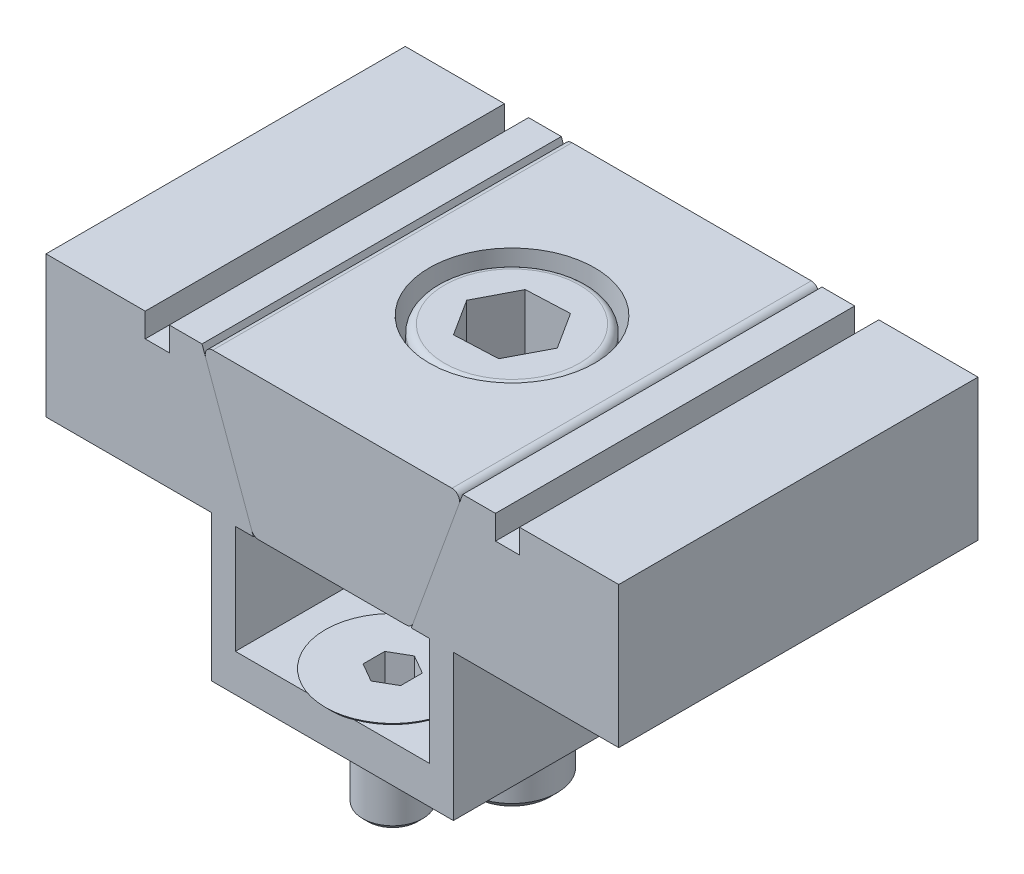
ISO-10303-21;
HEADER;
FILE_DESCRIPTION(('STEP AP214'),'2;1');
FILE_NAME('part.step','',(''),(''),'','','');
FILE_SCHEMA(('AUTOMOTIVE_DESIGN { 1 0 10303 214 1 1 1 1 }'));
ENDSEC;
DATA;
#1=APPLICATION_CONTEXT('core data for automotive mechanical design processes');
#2=APPLICATION_PROTOCOL_DEFINITION('international standard','automotive_design',2000,#1);
#3=PRODUCT_CONTEXT('',#1,'mechanical');
#4=PRODUCT('Part','Part','',(#3));
#5=PRODUCT_RELATED_PRODUCT_CATEGORY('part','',(#4));
#6=PRODUCT_DEFINITION_FORMATION('','',#4);
#7=PRODUCT_DEFINITION_CONTEXT('part definition',#1,'design');
#8=PRODUCT_DEFINITION('design','',#6,#7);
#9=PRODUCT_DEFINITION_SHAPE('','',#8);
#10=(LENGTH_UNIT() NAMED_UNIT(*) SI_UNIT(.MILLI.,.METRE.));
#11=(NAMED_UNIT(*) PLANE_ANGLE_UNIT() SI_UNIT($,.RADIAN.));
#12=(NAMED_UNIT(*) SI_UNIT($,.STERADIAN.) SOLID_ANGLE_UNIT());
#13=UNCERTAINTY_MEASURE_WITH_UNIT(LENGTH_MEASURE(1.E-05),#10,'distance_accuracy_value','');
#14=(GEOMETRIC_REPRESENTATION_CONTEXT(3) GLOBAL_UNCERTAINTY_ASSIGNED_CONTEXT((#13)) GLOBAL_UNIT_ASSIGNED_CONTEXT((#10,
#11,#12)) REPRESENTATION_CONTEXT('',''));
#15=CARTESIAN_POINT('',(0.,0.,0.));
#16=DIRECTION('',(0.,0.,1.));
#17=DIRECTION('',(1.,0.,0.));
#18=AXIS2_PLACEMENT_3D('',#15,#16,#17);
#19=CARTESIAN_POINT('',(0.,-9.47000000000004,6.49162432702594));
#20=DIRECTION('',(0.,1.,0.));
#21=DIRECTION('',(0.,0.,1.));
#22=AXIS2_PLACEMENT_3D('',#19,#20,#21);
#23=PLANE('',#22);
#24=DIRECTION('',(0.866025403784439,0.,0.5));
#25=VECTOR('',#24,1.);
#26=CARTESIAN_POINT('',(-1.25,-9.47000000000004,8.65668783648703));
#27=LINE('',#26,#25);
#28=CARTESIAN_POINT('',(-1.25,-9.47000000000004,8.65668783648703));
#29=VERTEX_POINT('',#28);
#30=CARTESIAN_POINT('',(-0.625000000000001,-9.47000000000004,9.01753175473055));
#31=VERTEX_POINT('',#30);
#32=EDGE_CURVE('P0_E127',#29,#31,#27,.T.);
#33=ORIENTED_EDGE('',*,*,#32,.T.);
#34=CARTESIAN_POINT('',(0.,-9.47000000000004,7.935));
#35=DIRECTION('',(0.,1.,0.));
#36=DIRECTION('',(0.,0.,1.));
#37=AXIS2_PLACEMENT_3D('',#34,#35,#36);
#38=CIRCLE('',#37,1.25);
#39=CARTESIAN_POINT('',(-1.25,-9.47000000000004,7.935));
#40=VERTEX_POINT('',#39);
#41=EDGE_CURVE('P0_E11',#31,#40,#38,.F.);
#42=ORIENTED_EDGE('',*,*,#41,.T.);
#43=DIRECTION('',(0.,0.,1.));
#44=VECTOR('',#43,1.);
#45=CARTESIAN_POINT('',(-1.25,-9.47000000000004,7.21331216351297));
#46=LINE('',#45,#44);
#47=EDGE_CURVE('P0_E122',#40,#29,#46,.T.);
#48=ORIENTED_EDGE('',*,*,#47,.T.);
#49=EDGE_LOOP('',(#33,#42,#48));
#50=FACE_BOUND('',#49,.T.);
#51=ADVANCED_FACE('P0_F16',(#50),#23,.T.);
#52=CARTESIAN_POINT('',(-1.25,-9.47000000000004,7.21331216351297));
#53=VERTEX_POINT('',#52);
#54=EDGE_CURVE('P0_E123',#53,#40,#46,.T.);
#55=ORIENTED_EDGE('',*,*,#54,.T.);
#56=CARTESIAN_POINT('',(-0.625,-9.47000000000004,6.85246824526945));
#57=VERTEX_POINT('',#56);
#58=EDGE_CURVE('P0_E25',#40,#57,#38,.F.);
#59=ORIENTED_EDGE('',*,*,#58,.T.);
#60=DIRECTION('',(-0.866025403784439,0.,0.5));
#61=VECTOR('',#60,1.);
#62=CARTESIAN_POINT('',(0.,-9.47000000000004,6.49162432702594));
#63=LINE('',#62,#61);
#64=EDGE_CURVE('P0_E119',#57,#53,#63,.T.);
#65=ORIENTED_EDGE('',*,*,#64,.T.);
#66=EDGE_LOOP('',(#55,#59,#65));
#67=FACE_BOUND('',#66,.T.);
#68=ADVANCED_FACE('P0_F210',(#67),#23,.T.);
#69=CARTESIAN_POINT('',(0.,-9.47000000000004,6.49162432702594));
#70=VERTEX_POINT('',#69);
#71=EDGE_CURVE('P0_E109',#70,#57,#63,.T.);
#72=ORIENTED_EDGE('',*,*,#71,.T.);
#73=CARTESIAN_POINT('',(0.625,-9.47000000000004,6.85246824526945));
#74=VERTEX_POINT('',#73);
#75=EDGE_CURVE('P0_E95',#57,#74,#38,.F.);
#76=ORIENTED_EDGE('',*,*,#75,.T.);
#77=DIRECTION('',(-0.866025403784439,0.,-0.5));
#78=VECTOR('',#77,1.);
#79=CARTESIAN_POINT('',(1.25,-9.47000000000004,7.21331216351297));
#80=LINE('',#79,#78);
#81=EDGE_CURVE('P0_E107',#74,#70,#80,.T.);
#82=ORIENTED_EDGE('',*,*,#81,.T.);
#83=EDGE_LOOP('',(#72,#76,#82));
#84=FACE_BOUND('',#83,.T.);
#85=ADVANCED_FACE('P0_F106',(#84),#23,.T.);
#86=CARTESIAN_POINT('',(1.25,-9.47000000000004,7.21331216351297));
#87=VERTEX_POINT('',#86);
#88=EDGE_CURVE('P0_E112',#87,#74,#80,.T.);
#89=ORIENTED_EDGE('',*,*,#88,.T.);
#90=CARTESIAN_POINT('',(0.,-9.47000000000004,7.935));
#91=DIRECTION('',(0.,-1.,0.));
#92=DIRECTION('',(0.,0.,-1.));
#93=AXIS2_PLACEMENT_3D('',#90,#91,#92);
#94=CIRCLE('',#93,1.25);
#95=CARTESIAN_POINT('',(1.25,-9.47000000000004,7.935));
#96=VERTEX_POINT('',#95);
#97=EDGE_CURVE('P0_E93',#74,#96,#94,.T.);
#98=ORIENTED_EDGE('',*,*,#97,.T.);
#99=DIRECTION('',(0.,0.,-1.));
#100=VECTOR('',#99,1.);
#101=CARTESIAN_POINT('',(1.25,-9.47000000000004,8.65668783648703));
#102=LINE('',#101,#100);
#103=EDGE_CURVE('P0_E117',#96,#87,#102,.T.);
#104=ORIENTED_EDGE('',*,*,#103,.T.);
#105=EDGE_LOOP('',(#89,#98,#104));
#106=FACE_BOUND('',#105,.T.);
#107=ADVANCED_FACE('P0_F116',(#106),#23,.T.);
#108=CARTESIAN_POINT('',(1.25,-9.47000000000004,8.65668783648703));
#109=VERTEX_POINT('',#108);
#110=EDGE_CURVE('P0_E134',#109,#96,#102,.T.);
#111=ORIENTED_EDGE('',*,*,#110,.T.);
#112=CARTESIAN_POINT('',(0.624999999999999,-9.47000000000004,9.01753175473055));
#113=VERTEX_POINT('',#112);
#114=EDGE_CURVE('P0_E98',#96,#113,#38,.F.);
#115=ORIENTED_EDGE('',*,*,#114,.T.);
#116=DIRECTION('',(0.866025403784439,0.,-0.5));
#117=VECTOR('',#116,1.);
#118=CARTESIAN_POINT('',(0.,-9.47000000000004,9.37837567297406));
#119=LINE('',#118,#117);
#120=EDGE_CURVE('P0_E130',#113,#109,#119,.T.);
#121=ORIENTED_EDGE('',*,*,#120,.T.);
#122=EDGE_LOOP('',(#111,#115,#121));
#123=FACE_BOUND('',#122,.T.);
#124=ADVANCED_FACE('P0_F179',(#123),#23,.T.);
#125=CARTESIAN_POINT('',(0.,-9.47000000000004,9.37837567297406));
#126=VERTEX_POINT('',#125);
#127=EDGE_CURVE('P0_E131',#126,#113,#119,.T.);
#128=ORIENTED_EDGE('',*,*,#127,.T.);
#129=EDGE_CURVE('P0_E20',#113,#31,#38,.F.);
#130=ORIENTED_EDGE('',*,*,#129,.T.);
#131=EDGE_CURVE('P0_E126',#31,#126,#27,.T.);
#132=ORIENTED_EDGE('',*,*,#131,.T.);
#133=EDGE_LOOP('',(#128,#130,#132));
#134=FACE_BOUND('',#133,.T.);
#135=ADVANCED_FACE('P0_F185',(#134),#23,.T.);
#136=CARTESIAN_POINT('',(0.,-14.97,7.935));
#137=DIRECTION('',(0.,1.,0.));
#138=DIRECTION('',(0.,0.,1.));
#139=AXIS2_PLACEMENT_3D('',#136,#137,#138);
#140=CYLINDRICAL_SURFACE('',#139,2.);
#141=CARTESIAN_POINT('',(0.,-14.62,7.935));
#142=DIRECTION('',(0.,1.,0.));
#143=DIRECTION('',(0.,0.,1.));
#144=AXIS2_PLACEMENT_3D('',#141,#142,#143);
#145=CIRCLE('',#144,2.);
#146=CARTESIAN_POINT('',(0.,-14.62,9.935));
#147=VERTEX_POINT('',#146);
#148=EDGE_CURVE('P0_E169',#147,#147,#145,.T.);
#149=ORIENTED_EDGE('',*,*,#148,.T.);
#150=EDGE_LOOP('',(#149));
#151=FACE_BOUND('',#150,.T.);
#152=CARTESIAN_POINT('',(0.,-9.45000000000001,7.935));
#153=DIRECTION('',(0.,1.,0.));
#154=DIRECTION('',(0.,0.,1.));
#155=AXIS2_PLACEMENT_3D('',#152,#153,#154);
#156=CIRCLE('',#155,2.);
#157=CARTESIAN_POINT('',(0.,-9.45000000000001,9.935));
#158=VERTEX_POINT('',#157);
#159=EDGE_CURVE('P0_E166',#158,#158,#156,.F.);
#160=ORIENTED_EDGE('',*,*,#159,.T.);
#161=EDGE_LOOP('',(#160));
#162=FACE_BOUND('',#161,.T.);
#163=ADVANCED_FACE('P0_F217',(#151,#162),#140,.T.);
#164=CARTESIAN_POINT('',(0.,-14.97,7.935));
#165=DIRECTION('',(0.,1.,0.));
#166=DIRECTION('',(0.,0.,1.));
#167=AXIS2_PLACEMENT_3D('',#164,#165,#166);
#168=PLANE('',#167);
#169=CARTESIAN_POINT('',(0.,-14.97,7.935));
#170=DIRECTION('',(0.,1.,0.));
#171=DIRECTION('',(0.,0.,1.));
#172=AXIS2_PLACEMENT_3D('',#169,#170,#171);
#173=CIRCLE('',#172,1.65);
#174=CARTESIAN_POINT('',(0.,-14.97,9.58499999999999));
#175=VERTEX_POINT('',#174);
#176=EDGE_CURVE('P0_E171',#175,#175,#173,.F.);
#177=ORIENTED_EDGE('',*,*,#176,.T.);
#178=EDGE_LOOP('',(#177));
#179=FACE_BOUND('',#178,.T.);
#180=ADVANCED_FACE('P0_F223',(#179),#168,.F.);
#181=CARTESIAN_POINT('',(0.,-6.97000000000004,7.935));
#182=DIRECTION('',(0.,1.,0.));
#183=DIRECTION('',(0.,0.,1.));
#184=AXIS2_PLACEMENT_3D('',#181,#182,#183);
#185=CONICAL_SURFACE('',#184,4.48,0.785398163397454);
#186=ORIENTED_EDGE('',*,*,#159,.F.);
#187=EDGE_LOOP('',(#186));
#188=FACE_BOUND('',#187,.T.);
#189=CARTESIAN_POINT('',(0.,-6.97000000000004,7.935));
#190=DIRECTION('',(0.,-1.,0.));
#191=DIRECTION('',(0.,0.,-1.));
#192=AXIS2_PLACEMENT_3D('',#189,#190,#191);
#193=CIRCLE('',#192,4.48);
#194=CARTESIAN_POINT('',(0.,-6.97000000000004,3.455));
#195=VERTEX_POINT('',#194);
#196=EDGE_CURVE('P0_E154',#195,#195,#193,.T.);
#197=ORIENTED_EDGE('',*,*,#196,.T.);
#198=EDGE_LOOP('',(#197));
#199=FACE_BOUND('',#198,.T.);
#200=ADVANCED_FACE('P0_F276',(#188,#199),#185,.T.);
#201=CARTESIAN_POINT('',(0.,-6.97000000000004,7.935));
#202=DIRECTION('',(0.,1.,0.));
#203=DIRECTION('',(0.,0.,1.));
#204=AXIS2_PLACEMENT_3D('',#201,#202,#203);
#205=PLANE('',#204);
#206=DIRECTION('',(-0.866025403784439,0.,-0.5));
#207=VECTOR('',#206,1.);
#208=CARTESIAN_POINT('',(1.25,-6.97000000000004,7.21331216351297));
#209=LINE('',#208,#207);
#210=CARTESIAN_POINT('',(1.25,-6.97000000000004,7.21331216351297));
#211=VERTEX_POINT('',#210);
#212=CARTESIAN_POINT('',(0.,-6.97000000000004,6.49162432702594));
#213=VERTEX_POINT('',#212);
#214=EDGE_CURVE('P0_E38',#211,#213,#209,.T.);
#215=ORIENTED_EDGE('',*,*,#214,.F.);
#216=DIRECTION('',(0.,0.,-1.));
#217=VECTOR('',#216,1.);
#218=CARTESIAN_POINT('',(1.25,-6.97000000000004,8.65668783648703));
#219=LINE('',#218,#217);
#220=CARTESIAN_POINT('',(1.25,-6.97000000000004,8.65668783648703));
#221=VERTEX_POINT('',#220);
#222=EDGE_CURVE('P0_E114',#221,#211,#219,.T.);
#223=ORIENTED_EDGE('',*,*,#222,.F.);
#224=DIRECTION('',(0.866025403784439,0.,-0.5));
#225=VECTOR('',#224,1.);
#226=CARTESIAN_POINT('',(0.,-6.97000000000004,9.37837567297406));
#227=LINE('',#226,#225);
#228=CARTESIAN_POINT('',(0.,-6.97000000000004,9.37837567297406));
#229=VERTEX_POINT('',#228);
#230=EDGE_CURVE('P0_E147',#229,#221,#227,.T.);
#231=ORIENTED_EDGE('',*,*,#230,.F.);
#232=DIRECTION('',(0.866025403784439,0.,0.5));
#233=VECTOR('',#232,1.);
#234=CARTESIAN_POINT('',(-1.25,-6.97000000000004,8.65668783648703));
#235=LINE('',#234,#233);
#236=CARTESIAN_POINT('',(-1.25,-6.97000000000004,8.65668783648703));
#237=VERTEX_POINT('',#236);
#238=EDGE_CURVE('P0_E144',#237,#229,#235,.T.);
#239=ORIENTED_EDGE('',*,*,#238,.F.);
#240=DIRECTION('',(0.,0.,1.));
#241=VECTOR('',#240,1.);
#242=CARTESIAN_POINT('',(-1.25,-6.97000000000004,7.21331216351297));
#243=LINE('',#242,#241);
#244=CARTESIAN_POINT('',(-1.25,-6.97000000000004,7.21331216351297));
#245=VERTEX_POINT('',#244);
#246=EDGE_CURVE('P0_E141',#245,#237,#243,.T.);
#247=ORIENTED_EDGE('',*,*,#246,.F.);
#248=DIRECTION('',(-0.866025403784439,0.,0.5));
#249=VECTOR('',#248,1.);
#250=CARTESIAN_POINT('',(0.,-6.97000000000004,6.49162432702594));
#251=LINE('',#250,#249);
#252=EDGE_CURVE('P0_E138',#213,#245,#251,.T.);
#253=ORIENTED_EDGE('',*,*,#252,.F.);
#254=EDGE_LOOP('',(#215,#223,#231,#239,#247,#253));
#255=FACE_BOUND('',#254,.T.);
#256=ORIENTED_EDGE('',*,*,#196,.F.);
#257=EDGE_LOOP('',(#256));
#258=FACE_BOUND('',#257,.T.);
#259=ADVANCED_FACE('P0_F194',(#255,#258),#205,.T.);
#260=CARTESIAN_POINT('',(0.,-14.62,7.935));
#261=DIRECTION('',(0.,1.,0.));
#262=DIRECTION('',(0.,0.,1.));
#263=AXIS2_PLACEMENT_3D('',#260,#261,#262);
#264=CONICAL_SURFACE('',#263,2.,0.785398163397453);
#265=CARTESIAN_POINT('',(0.,-14.97,9.58499999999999));
#266=CARTESIAN_POINT('',(0.,-14.9663541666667,9.58864583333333));
#267=CARTESIAN_POINT('',(0.,-14.9627083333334,9.59229166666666));
#268=CARTESIAN_POINT('',(0.,-14.9554166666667,9.59958333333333));
#269=CARTESIAN_POINT('',(0.,-14.9517708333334,9.60322916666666));
#270=CARTESIAN_POINT('',(0.,-14.9444791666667,9.61052083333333));
#271=CARTESIAN_POINT('',(0.,-14.9408333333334,9.61416666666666));
#272=CARTESIAN_POINT('',(0.,-14.9335416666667,9.62145833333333));
#273=CARTESIAN_POINT('',(0.,-14.9298958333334,9.62510416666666));
#274=CARTESIAN_POINT('',(0.,-14.9226041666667,9.63239583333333));
#275=CARTESIAN_POINT('',(0.,-14.9189583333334,9.63604166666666));
#276=CARTESIAN_POINT('',(0.,-14.9116666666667,9.64333333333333));
#277=CARTESIAN_POINT('',(0.,-14.9080208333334,9.64697916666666));
#278=CARTESIAN_POINT('',(0.,-14.9007291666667,9.65427083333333));
#279=CARTESIAN_POINT('',(0.,-14.8970833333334,9.65791666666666));
#280=CARTESIAN_POINT('',(0.,-14.8897916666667,9.66520833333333));
#281=CARTESIAN_POINT('',(0.,-14.8861458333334,9.66885416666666));
#282=CARTESIAN_POINT('',(0.,-14.8788541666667,9.67614583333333));
#283=CARTESIAN_POINT('',(0.,-14.8752083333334,9.67979166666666));
#284=CARTESIAN_POINT('',(0.,-14.8679166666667,9.68708333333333));
#285=CARTESIAN_POINT('',(0.,-14.8642708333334,9.69072916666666));
#286=CARTESIAN_POINT('',(0.,-14.8569791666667,9.69802083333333));
#287=CARTESIAN_POINT('',(0.,-14.8533333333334,9.70166666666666));
#288=CARTESIAN_POINT('',(0.,-14.8460416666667,9.70895833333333));
#289=CARTESIAN_POINT('',(0.,-14.8423958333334,9.71260416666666));
#290=CARTESIAN_POINT('',(0.,-14.8351041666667,9.71989583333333));
#291=CARTESIAN_POINT('',(0.,-14.8314583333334,9.72354166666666));
#292=CARTESIAN_POINT('',(0.,-14.8241666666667,9.73083333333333));
#293=CARTESIAN_POINT('',(0.,-14.8205208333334,9.73447916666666));
#294=CARTESIAN_POINT('',(0.,-14.8132291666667,9.74177083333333));
#295=CARTESIAN_POINT('',(0.,-14.8095833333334,9.74541666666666));
#296=CARTESIAN_POINT('',(0.,-14.8022916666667,9.75270833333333));
#297=CARTESIAN_POINT('',(0.,-14.7986458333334,9.75635416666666));
#298=CARTESIAN_POINT('',(0.,-14.7913541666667,9.76364583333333));
#299=CARTESIAN_POINT('',(0.,-14.7877083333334,9.76729166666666));
#300=CARTESIAN_POINT('',(0.,-14.7804166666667,9.77458333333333));
#301=CARTESIAN_POINT('',(0.,-14.7767708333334,9.77822916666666));
#302=CARTESIAN_POINT('',(0.,-14.7694791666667,9.78552083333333));
#303=CARTESIAN_POINT('',(0.,-14.7658333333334,9.78916666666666));
#304=CARTESIAN_POINT('',(0.,-14.7585416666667,9.79645833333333));
#305=CARTESIAN_POINT('',(0.,-14.7548958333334,9.80010416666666));
#306=CARTESIAN_POINT('',(0.,-14.7476041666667,9.80739583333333));
#307=CARTESIAN_POINT('',(0.,-14.7439583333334,9.81104166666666));
#308=CARTESIAN_POINT('',(0.,-14.7366666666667,9.81833333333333));
#309=CARTESIAN_POINT('',(0.,-14.7330208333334,9.82197916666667));
#310=CARTESIAN_POINT('',(0.,-14.7257291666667,9.82927083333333));
#311=CARTESIAN_POINT('',(0.,-14.7220833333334,9.83291666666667));
#312=CARTESIAN_POINT('',(0.,-14.7147916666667,9.84020833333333));
#313=CARTESIAN_POINT('',(0.,-14.7111458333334,9.84385416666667));
#314=CARTESIAN_POINT('',(0.,-14.7038541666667,9.85114583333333));
#315=CARTESIAN_POINT('',(0.,-14.7002083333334,9.85479166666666));
#316=CARTESIAN_POINT('',(0.,-14.6929166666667,9.86208333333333));
#317=CARTESIAN_POINT('',(0.,-14.6892708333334,9.86572916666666));
#318=CARTESIAN_POINT('',(0.,-14.6819791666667,9.87302083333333));
#319=CARTESIAN_POINT('',(0.,-14.6783333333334,9.87666666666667));
#320=CARTESIAN_POINT('',(0.,-14.6710416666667,9.88395833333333));
#321=CARTESIAN_POINT('',(0.,-14.6673958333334,9.88760416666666));
#322=CARTESIAN_POINT('',(0.,-14.6601041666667,9.89489583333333));
#323=CARTESIAN_POINT('',(0.,-14.6564583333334,9.89854166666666));
#324=CARTESIAN_POINT('',(0.,-14.6491666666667,9.90583333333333));
#325=CARTESIAN_POINT('',(0.,-14.6455208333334,9.90947916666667));
#326=CARTESIAN_POINT('',(0.,-14.6382291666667,9.91677083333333));
#327=CARTESIAN_POINT('',(0.,-14.6345833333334,9.92041666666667));
#328=CARTESIAN_POINT('',(0.,-14.6272916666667,9.92770833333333));
#329=CARTESIAN_POINT('',(0.,-14.6236458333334,9.93135416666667));
#330=CARTESIAN_POINT('',(0.,-14.62,9.935));
#331=B_SPLINE_CURVE_WITH_KNOTS('',3,(#265,#266,#267,#268,#269,#270,#271,#272,#273,#274,#275,
#276,#277,#278,#279,#280,#281,#282,#283,#284,#285,#286,#287,#288,#289,#290,#291,#292,#293,#294,
#295,#296,#297,#298,#299,#300,#301,#302,#303,#304,#305,#306,#307,#308,#309,#310,#311,#312,#313,
#314,#315,#316,#317,#318,#319,#320,#321,#322,#323,#324,#325,#326,#327,#328,#329,#330),
.UNSPECIFIED.,.F.,.F.,(4,2,2,2,2,2,2,2,2,2,2,2,2,2,2,2,2,2,2,2,2,2,2,2,2,2,2,2,2,2,2,2,4),(0.,
0.0154679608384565,0.030935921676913,0.0464038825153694,0.0618718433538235,0.0773398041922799,
0.0928077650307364,0.108275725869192,0.123743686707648,0.139211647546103,0.154679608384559,
0.170147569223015,0.18561553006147,0.201083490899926,0.216551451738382,0.232019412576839,
0.247487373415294,0.262955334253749,0.278423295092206,0.293891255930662,0.309359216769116,
0.324827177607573,0.340295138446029,0.355763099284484,0.371231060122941,0.386699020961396,
0.402166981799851,0.417634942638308,0.433102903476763,0.448570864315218,0.464038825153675,
0.479506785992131,0.494974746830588),.UNSPECIFIED.);
#332=EDGE_CURVE('P0_BSEAM18',#175,#147,#331,.T.);
#333=ORIENTED_EDGE('',*,*,#176,.F.);
#334=ORIENTED_EDGE('',*,*,#148,.F.);
#335=ORIENTED_EDGE('',*,*,#332,.T.);
#336=ORIENTED_EDGE('',*,*,#332,.F.);
#337=EDGE_LOOP('',(#333,#335,#334,#336));
#338=FACE_BOUND('',#337,.T.);
#339=ADVANCED_FACE('P0_F18',(#338),#264,.T.);
#340=CARTESIAN_POINT('',(1.25,-9.47000000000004,7.21331216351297));
#341=DIRECTION('',(0.5,0.,-0.866025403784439));
#342=DIRECTION('',(-0.866025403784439,0.,-0.5));
#343=AXIS2_PLACEMENT_3D('',#340,#341,#342);
#344=PLANE('',#343);
#345=ORIENTED_EDGE('',*,*,#214,.T.);
#346=DIRECTION('',(0.,1.,0.));
#347=VECTOR('',#346,1.);
#348=CARTESIAN_POINT('',(0.,-9.47000000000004,6.49162432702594));
#349=LINE('',#348,#347);
#350=EDGE_CURVE('P0_E113',#70,#213,#349,.T.);
#351=ORIENTED_EDGE('',*,*,#350,.F.);
#352=ORIENTED_EDGE('',*,*,#81,.F.);
#353=ORIENTED_EDGE('',*,*,#88,.F.);
#354=DIRECTION('',(0.,1.,0.));
#355=VECTOR('',#354,1.);
#356=CARTESIAN_POINT('',(1.25,-9.47000000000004,7.21331216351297));
#357=LINE('',#356,#355);
#358=EDGE_CURVE('P0_E152',#87,#211,#357,.T.);
#359=ORIENTED_EDGE('',*,*,#358,.T.);
#360=EDGE_LOOP('',(#345,#351,#352,#353,#359));
#361=FACE_BOUND('',#360,.T.);
#362=ADVANCED_FACE('P0_F111',(#361),#344,.F.);
#363=CARTESIAN_POINT('',(1.25,-9.47000000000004,8.65668783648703));
#364=DIRECTION('',(1.,0.,0.));
#365=DIRECTION('',(0.,0.,-1.));
#366=AXIS2_PLACEMENT_3D('',#363,#364,#365);
#367=PLANE('',#366);
#368=ORIENTED_EDGE('',*,*,#222,.T.);
#369=ORIENTED_EDGE('',*,*,#358,.F.);
#370=ORIENTED_EDGE('',*,*,#103,.F.);
#371=ORIENTED_EDGE('',*,*,#110,.F.);
#372=DIRECTION('',(0.,1.,0.));
#373=VECTOR('',#372,1.);
#374=CARTESIAN_POINT('',(1.25,-9.47000000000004,8.65668783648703));
#375=LINE('',#374,#373);
#376=EDGE_CURVE('P0_E155',#109,#221,#375,.T.);
#377=ORIENTED_EDGE('',*,*,#376,.T.);
#378=EDGE_LOOP('',(#368,#369,#370,#371,#377));
#379=FACE_BOUND('',#378,.T.);
#380=ADVANCED_FACE('P0_F198',(#379),#367,.F.);
#381=CARTESIAN_POINT('',(0.,-9.47000000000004,9.37837567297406));
#382=DIRECTION('',(0.5,0.,0.866025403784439));
#383=DIRECTION('',(0.866025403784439,0.,-0.5));
#384=AXIS2_PLACEMENT_3D('',#381,#382,#383);
#385=PLANE('',#384);
#386=ORIENTED_EDGE('',*,*,#230,.T.);
#387=ORIENTED_EDGE('',*,*,#376,.F.);
#388=ORIENTED_EDGE('',*,*,#120,.F.);
#389=ORIENTED_EDGE('',*,*,#127,.F.);
#390=DIRECTION('',(0.,1.,0.));
#391=VECTOR('',#390,1.);
#392=CARTESIAN_POINT('',(0.,-9.47000000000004,9.37837567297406));
#393=LINE('',#392,#391);
#394=EDGE_CURVE('P0_E157',#126,#229,#393,.T.);
#395=ORIENTED_EDGE('',*,*,#394,.T.);
#396=EDGE_LOOP('',(#386,#387,#388,#389,#395));
#397=FACE_BOUND('',#396,.T.);
#398=ADVANCED_FACE('P0_F184',(#397),#385,.F.);
#399=CARTESIAN_POINT('',(-1.25,-9.47000000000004,8.65668783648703));
#400=DIRECTION('',(-0.5,0.,0.866025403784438));
#401=DIRECTION('',(0.866025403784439,0.,0.5));
#402=AXIS2_PLACEMENT_3D('',#399,#400,#401);
#403=PLANE('',#402);
#404=ORIENTED_EDGE('',*,*,#238,.T.);
#405=ORIENTED_EDGE('',*,*,#394,.F.);
#406=ORIENTED_EDGE('',*,*,#131,.F.);
#407=ORIENTED_EDGE('',*,*,#32,.F.);
#408=DIRECTION('',(0.,1.,0.));
#409=VECTOR('',#408,1.);
#410=CARTESIAN_POINT('',(-1.25,-9.47000000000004,8.65668783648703));
#411=LINE('',#410,#409);
#412=EDGE_CURVE('P0_E159',#29,#237,#411,.T.);
#413=ORIENTED_EDGE('',*,*,#412,.T.);
#414=EDGE_LOOP('',(#404,#405,#406,#407,#413));
#415=FACE_BOUND('',#414,.T.);
#416=ADVANCED_FACE('P0_F189',(#415),#403,.F.);
#417=CARTESIAN_POINT('',(-1.25,-9.47000000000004,7.21331216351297));
#418=DIRECTION('',(-1.,0.,0.));
#419=DIRECTION('',(0.,0.,1.));
#420=AXIS2_PLACEMENT_3D('',#417,#418,#419);
#421=PLANE('',#420);
#422=ORIENTED_EDGE('',*,*,#246,.T.);
#423=ORIENTED_EDGE('',*,*,#412,.F.);
#424=ORIENTED_EDGE('',*,*,#47,.F.);
#425=ORIENTED_EDGE('',*,*,#54,.F.);
#426=DIRECTION('',(0.,1.,0.));
#427=VECTOR('',#426,1.);
#428=CARTESIAN_POINT('',(-1.25,-9.47000000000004,7.21331216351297));
#429=LINE('',#428,#427);
#430=EDGE_CURVE('P0_E161',#53,#245,#429,.T.);
#431=ORIENTED_EDGE('',*,*,#430,.T.);
#432=EDGE_LOOP('',(#422,#423,#424,#425,#431));
#433=FACE_BOUND('',#432,.T.);
#434=ADVANCED_FACE('P0_F320',(#433),#421,.F.);
#435=CARTESIAN_POINT('',(0.,-9.47000000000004,6.49162432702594));
#436=DIRECTION('',(-0.5,0.,-0.866025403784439));
#437=DIRECTION('',(-0.866025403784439,0.,0.5));
#438=AXIS2_PLACEMENT_3D('',#435,#436,#437);
#439=PLANE('',#438);
#440=ORIENTED_EDGE('',*,*,#252,.T.);
#441=ORIENTED_EDGE('',*,*,#430,.F.);
#442=ORIENTED_EDGE('',*,*,#64,.F.);
#443=ORIENTED_EDGE('',*,*,#71,.F.);
#444=ORIENTED_EDGE('',*,*,#350,.T.);
#445=EDGE_LOOP('',(#440,#441,#442,#443,#444));
#446=FACE_BOUND('',#445,.T.);
#447=ADVANCED_FACE('P0_F90',(#446),#439,.F.);
#448=CARTESIAN_POINT('',(0.,-9.47000000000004,7.935));
#449=DIRECTION('',(0.,1.,0.));
#450=DIRECTION('',(0.,0.,1.));
#451=AXIS2_PLACEMENT_3D('',#448,#449,#450);
#452=CONICAL_SURFACE('',#451,1.25,1.0471975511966);
#453=CARTESIAN_POINT('',(0.,-10.1916878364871,7.935));
#454=VERTEX_POINT('',#453);
#455=VERTEX_LOOP('',#454);
#456=FACE_BOUND('',#455,.T.);
#457=ORIENTED_EDGE('',*,*,#97,.F.);
#458=ORIENTED_EDGE('',*,*,#75,.F.);
#459=ORIENTED_EDGE('',*,*,#58,.F.);
#460=ORIENTED_EDGE('',*,*,#41,.F.);
#461=ORIENTED_EDGE('',*,*,#129,.F.);
#462=ORIENTED_EDGE('',*,*,#114,.F.);
#463=EDGE_LOOP('',(#457,#458,#459,#460,#461,#462));
#464=FACE_BOUND('',#463,.T.);
#465=ADVANCED_FACE('P0_F88',(#456,#464),#452,.F.);
#466=CLOSED_SHELL('',(#51,#68,#85,#107,#124,#135,#163,#180,#200,#259,#339,#362,#380,#398,#416,
#434,#447,#465));
#467=MANIFOLD_SOLID_BREP('P0_B1',#466);
#468=CARTESIAN_POINT('',(0.,2.90000000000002,0.));
#469=DIRECTION('',(0.,-1.,0.));
#470=DIRECTION('',(-0.887264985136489,0.,-0.461260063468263));
#471=AXIS2_PLACEMENT_3D('',#468,#469,#470);
#472=CYLINDRICAL_SURFACE('',#471,3.);
#473=CARTESIAN_POINT('',(0.,-16.6,0.));
#474=DIRECTION('',(0.,1.,0.));
#475=DIRECTION('',(0.887264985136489,0.,0.461260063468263));
#476=AXIS2_PLACEMENT_3D('',#473,#474,#475);
#477=CIRCLE('',#476,3.);
#478=CARTESIAN_POINT('',(2.66179495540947,-16.6,1.38378019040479));
#479=VERTEX_POINT('',#478);
#480=EDGE_CURVE('P1_E24',#479,#479,#477,.T.);
#481=ORIENTED_EDGE('',*,*,#480,.T.);
#482=EDGE_LOOP('',(#481));
#483=FACE_BOUND('',#482,.T.);
#484=CARTESIAN_POINT('',(0.,2.90000000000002,0.));
#485=DIRECTION('',(0.,1.,0.));
#486=DIRECTION('',(0.887264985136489,0.,0.461260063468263));
#487=AXIS2_PLACEMENT_3D('',#484,#485,#486);
#488=CIRCLE('',#487,3.);
#489=CARTESIAN_POINT('',(2.66179495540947,2.90000000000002,1.38378019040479));
#490=VERTEX_POINT('',#489);
#491=EDGE_CURVE('P1_E126',#490,#490,#488,.T.);
#492=ORIENTED_EDGE('',*,*,#491,.F.);
#493=EDGE_LOOP('',(#492));
#494=FACE_BOUND('',#493,.T.);
#495=ADVANCED_FACE('P1_F16',(#483,#494),#472,.T.);
#496=CARTESIAN_POINT('',(0.,-17.1,0.));
#497=DIRECTION('',(0.,1.,0.));
#498=DIRECTION('',(0.887264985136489,0.,0.461260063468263));
#499=AXIS2_PLACEMENT_3D('',#496,#497,#498);
#500=PLANE('',#499);
#501=CARTESIAN_POINT('',(0.,-17.1,0.));
#502=DIRECTION('',(0.,1.,0.));
#503=DIRECTION('',(0.887264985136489,0.,0.461260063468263));
#504=AXIS2_PLACEMENT_3D('',#501,#502,#503);
#505=CIRCLE('',#504,2.5);
#506=CARTESIAN_POINT('',(2.21816246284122,-17.1,1.15315015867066));
#507=VERTEX_POINT('',#506);
#508=EDGE_CURVE('P1_E11',#507,#507,#505,.F.);
#509=ORIENTED_EDGE('',*,*,#508,.T.);
#510=EDGE_LOOP('',(#509));
#511=FACE_BOUND('',#510,.T.);
#512=ADVANCED_FACE('P1_F149',(#511),#500,.F.);
#513=CARTESIAN_POINT('',(0.,2.90000000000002,0.));
#514=DIRECTION('',(0.,1.,0.));
#515=DIRECTION('',(0.887264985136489,0.,0.461260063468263));
#516=AXIS2_PLACEMENT_3D('',#513,#514,#515);
#517=PLANE('',#516);
#518=CARTESIAN_POINT('',(0.,2.90000000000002,0.));
#519=DIRECTION('',(0.,1.,0.));
#520=DIRECTION('',(0.887264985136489,0.,0.461260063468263));
#521=AXIS2_PLACEMENT_3D('',#518,#519,#520);
#522=CIRCLE('',#521,5.);
#523=CARTESIAN_POINT('',(4.43632492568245,2.90000000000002,2.30630031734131));
#524=VERTEX_POINT('',#523);
#525=EDGE_CURVE('P1_E118',#524,#524,#522,.T.);
#526=ORIENTED_EDGE('',*,*,#525,.F.);
#527=EDGE_LOOP('',(#526));
#528=FACE_BOUND('',#527,.T.);
#529=ORIENTED_EDGE('',*,*,#491,.T.);
#530=EDGE_LOOP('',(#529));
#531=FACE_BOUND('',#530,.T.);
#532=ADVANCED_FACE('P1_F154',(#528,#531),#517,.F.);
#533=CARTESIAN_POINT('',(0.,8.90000000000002,0.));
#534=DIRECTION('',(0.,-1.,0.));
#535=DIRECTION('',(-0.887264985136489,0.,-0.461260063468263));
#536=AXIS2_PLACEMENT_3D('',#533,#534,#535);
#537=CYLINDRICAL_SURFACE('',#536,5.);
#538=CARTESIAN_POINT('',(0.,8.40000000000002,0.));
#539=DIRECTION('',(0.,1.,0.));
#540=DIRECTION('',(0.887264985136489,0.,0.461260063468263));
#541=AXIS2_PLACEMENT_3D('',#538,#539,#540);
#542=CIRCLE('',#541,5.);
#543=CARTESIAN_POINT('',(4.43632492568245,8.40000000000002,2.30630031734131));
#544=VERTEX_POINT('',#543);
#545=EDGE_CURVE('P1_E132',#544,#544,#542,.F.);
#546=ORIENTED_EDGE('',*,*,#545,.T.);
#547=EDGE_LOOP('',(#546));
#548=FACE_BOUND('',#547,.T.);
#549=ORIENTED_EDGE('',*,*,#525,.T.);
#550=EDGE_LOOP('',(#549));
#551=FACE_BOUND('',#550,.T.);
#552=ADVANCED_FACE('P1_F158',(#548,#551),#537,.T.);
#553=CARTESIAN_POINT('',(0.,8.90000000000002,0.));
#554=DIRECTION('',(0.,1.,0.));
#555=DIRECTION('',(0.887264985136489,0.,0.461260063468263));
#556=AXIS2_PLACEMENT_3D('',#553,#554,#555);
#557=PLANE('',#556);
#558=CARTESIAN_POINT('',(0.,8.90000000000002,0.));
#559=DIRECTION('',(0.,1.,0.));
#560=DIRECTION('',(0.887264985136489,0.,0.461260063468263));
#561=AXIS2_PLACEMENT_3D('',#558,#559,#560);
#562=CIRCLE('',#561,4.5);
#563=CARTESIAN_POINT('',(3.9926924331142,8.90000000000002,2.07567028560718));
#564=VERTEX_POINT('',#563);
#565=EDGE_CURVE('P1_E129',#564,#564,#562,.T.);
#566=ORIENTED_EDGE('',*,*,#565,.T.);
#567=EDGE_LOOP('',(#566));
#568=FACE_BOUND('',#567,.T.);
#569=DIRECTION('',(-0.999024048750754,0.,0.0441695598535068));
#570=VECTOR('',#569,1.);
#571=CARTESIAN_POINT('',(1.33154310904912,8.90000000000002,-2.56131339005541));
#572=LINE('',#571,#570);
#573=CARTESIAN_POINT('',(1.33154310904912,8.90000000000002,-2.56131339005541));
#574=VERTEX_POINT('',#573);
#575=CARTESIAN_POINT('',(-1.55239090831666,8.90000000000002,-2.43380685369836));
#576=VERTEX_POINT('',#575);
#577=EDGE_CURVE('P1_E31',#574,#576,#572,.T.);
#578=ORIENTED_EDGE('',*,*,#577,.F.);
#579=DIRECTION('',(-0.537763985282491,0.,-0.843095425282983));
#580=VECTOR('',#579,1.);
#581=CARTESIAN_POINT('',(2.88393401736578,8.90000000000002,-0.127506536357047));
#582=LINE('',#581,#580);
#583=CARTESIAN_POINT('',(2.88393401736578,8.90000000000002,-0.127506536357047));
#584=VERTEX_POINT('',#583);
#585=EDGE_CURVE('P1_E114',#584,#574,#582,.T.);
#586=ORIENTED_EDGE('',*,*,#585,.F.);
#587=DIRECTION('',(0.461260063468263,0.,-0.887264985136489));
#588=VECTOR('',#587,1.);
#589=CARTESIAN_POINT('',(1.55239090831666,8.90000000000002,2.43380685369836));
#590=LINE('',#589,#588);
#591=CARTESIAN_POINT('',(1.55239090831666,8.90000000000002,2.43380685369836));
#592=VERTEX_POINT('',#591);
#593=EDGE_CURVE('P1_E112',#592,#584,#590,.T.);
#594=ORIENTED_EDGE('',*,*,#593,.F.);
#595=DIRECTION('',(0.999024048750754,0.,-0.0441695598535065));
#596=VECTOR('',#595,1.);
#597=CARTESIAN_POINT('',(-1.33154310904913,8.90000000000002,2.56131339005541));
#598=LINE('',#597,#596);
#599=CARTESIAN_POINT('',(-1.33154310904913,8.90000000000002,2.56131339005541));
#600=VERTEX_POINT('',#599);
#601=EDGE_CURVE('P1_E79',#600,#592,#598,.T.);
#602=ORIENTED_EDGE('',*,*,#601,.F.);
#603=DIRECTION('',(0.537763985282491,0.,0.843095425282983));
#604=VECTOR('',#603,1.);
#605=CARTESIAN_POINT('',(-2.88393401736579,8.90000000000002,0.127506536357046));
#606=LINE('',#605,#604);
#607=CARTESIAN_POINT('',(-2.88393401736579,8.90000000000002,0.127506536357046));
#608=VERTEX_POINT('',#607);
#609=EDGE_CURVE('P1_E108',#608,#600,#606,.T.);
#610=ORIENTED_EDGE('',*,*,#609,.F.);
#611=DIRECTION('',(-0.461260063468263,0.,0.887264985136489));
#612=VECTOR('',#611,1.);
#613=CARTESIAN_POINT('',(-1.55239090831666,8.90000000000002,-2.43380685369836));
#614=LINE('',#613,#612);
#615=EDGE_CURVE('P1_E105',#576,#608,#614,.T.);
#616=ORIENTED_EDGE('',*,*,#615,.F.);
#617=EDGE_LOOP('',(#578,#586,#594,#602,#610,#616));
#618=FACE_BOUND('',#617,.T.);
#619=ADVANCED_FACE('P1_F161',(#568,#618),#557,.T.);
#620=CARTESIAN_POINT('',(1.33154310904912,3.90000000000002,-2.56131339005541));
#621=DIRECTION('',(-0.0441695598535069,0.,-0.999024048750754));
#622=DIRECTION('',(-0.999024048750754,0.,0.0441695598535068));
#623=AXIS2_PLACEMENT_3D('',#620,#621,#622);
#624=PLANE('',#623);
#625=ORIENTED_EDGE('',*,*,#577,.T.);
#626=DIRECTION('',(0.,1.,0.));
#627=VECTOR('',#626,1.);
#628=CARTESIAN_POINT('',(-1.55239090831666,3.90000000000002,-2.43380685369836));
#629=LINE('',#628,#627);
#630=CARTESIAN_POINT('',(-1.55239090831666,3.90000000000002,-2.43380685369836));
#631=VERTEX_POINT('',#630);
#632=EDGE_CURVE('P1_E61',#631,#576,#629,.T.);
#633=ORIENTED_EDGE('',*,*,#632,.F.);
#634=DIRECTION('',(-0.999024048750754,0.,0.0441695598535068));
#635=VECTOR('',#634,1.);
#636=CARTESIAN_POINT('',(1.33154310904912,3.90000000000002,-2.56131339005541));
#637=LINE('',#636,#635);
#638=CARTESIAN_POINT('',(1.33154310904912,3.90000000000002,-2.56131339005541));
#639=VERTEX_POINT('',#638);
#640=EDGE_CURVE('P1_E116',#639,#631,#637,.T.);
#641=ORIENTED_EDGE('',*,*,#640,.F.);
#642=DIRECTION('',(0.,1.,0.));
#643=VECTOR('',#642,1.);
#644=CARTESIAN_POINT('',(1.33154310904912,3.90000000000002,-2.56131339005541));
#645=LINE('',#644,#643);
#646=EDGE_CURVE('P1_E39',#639,#574,#645,.T.);
#647=ORIENTED_EDGE('',*,*,#646,.T.);
#648=EDGE_LOOP('',(#625,#633,#641,#647));
#649=FACE_BOUND('',#648,.T.);
#650=ADVANCED_FACE('P1_F168',(#649),#624,.F.);
#651=CARTESIAN_POINT('',(2.88393401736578,3.90000000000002,-0.127506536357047));
#652=DIRECTION('',(0.843095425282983,0.,-0.537763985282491));
#653=DIRECTION('',(-0.537763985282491,0.,-0.843095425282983));
#654=AXIS2_PLACEMENT_3D('',#651,#652,#653);
#655=PLANE('',#654);
#656=ORIENTED_EDGE('',*,*,#585,.T.);
#657=ORIENTED_EDGE('',*,*,#646,.F.);
#658=DIRECTION('',(-0.537763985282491,0.,-0.843095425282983));
#659=VECTOR('',#658,1.);
#660=CARTESIAN_POINT('',(2.88393401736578,3.90000000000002,-0.127506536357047));
#661=LINE('',#660,#659);
#662=CARTESIAN_POINT('',(2.88393401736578,3.90000000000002,-0.127506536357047));
#663=VERTEX_POINT('',#662);
#664=EDGE_CURVE('P1_E91',#663,#639,#661,.T.);
#665=ORIENTED_EDGE('',*,*,#664,.F.);
#666=DIRECTION('',(0.,1.,0.));
#667=VECTOR('',#666,1.);
#668=CARTESIAN_POINT('',(2.88393401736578,3.90000000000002,-0.127506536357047));
#669=LINE('',#668,#667);
#670=EDGE_CURVE('P1_E83',#663,#584,#669,.T.);
#671=ORIENTED_EDGE('',*,*,#670,.T.);
#672=EDGE_LOOP('',(#656,#657,#665,#671));
#673=FACE_BOUND('',#672,.T.);
#674=ADVANCED_FACE('P1_F172',(#673),#655,.F.);
#675=CARTESIAN_POINT('',(1.55239090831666,3.90000000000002,2.43380685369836));
#676=DIRECTION('',(0.887264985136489,0.,0.461260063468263));
#677=DIRECTION('',(0.461260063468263,0.,-0.887264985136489));
#678=AXIS2_PLACEMENT_3D('',#675,#676,#677);
#679=PLANE('',#678);
#680=ORIENTED_EDGE('',*,*,#593,.T.);
#681=ORIENTED_EDGE('',*,*,#670,.F.);
#682=DIRECTION('',(0.461260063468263,0.,-0.887264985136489));
#683=VECTOR('',#682,1.);
#684=CARTESIAN_POINT('',(1.55239090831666,3.90000000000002,2.43380685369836));
#685=LINE('',#684,#683);
#686=CARTESIAN_POINT('',(1.55239090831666,3.90000000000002,2.43380685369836));
#687=VERTEX_POINT('',#686);
#688=EDGE_CURVE('P1_E87',#687,#663,#685,.T.);
#689=ORIENTED_EDGE('',*,*,#688,.F.);
#690=DIRECTION('',(0.,1.,0.));
#691=VECTOR('',#690,1.);
#692=CARTESIAN_POINT('',(1.55239090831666,3.90000000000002,2.43380685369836));
#693=LINE('',#692,#691);
#694=EDGE_CURVE('P1_E72',#687,#592,#693,.T.);
#695=ORIENTED_EDGE('',*,*,#694,.T.);
#696=EDGE_LOOP('',(#680,#681,#689,#695));
#697=FACE_BOUND('',#696,.T.);
#698=ADVANCED_FACE('P1_F88',(#697),#679,.F.);
#699=CARTESIAN_POINT('',(-1.33154310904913,3.90000000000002,2.56131339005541));
#700=DIRECTION('',(0.0441695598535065,0.,0.999024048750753));
#701=DIRECTION('',(0.999024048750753,0.,-0.0441695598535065));
#702=AXIS2_PLACEMENT_3D('',#699,#700,#701);
#703=PLANE('',#702);
#704=ORIENTED_EDGE('',*,*,#601,.T.);
#705=ORIENTED_EDGE('',*,*,#694,.F.);
#706=DIRECTION('',(0.999024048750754,0.,-0.0441695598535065));
#707=VECTOR('',#706,1.);
#708=CARTESIAN_POINT('',(-1.33154310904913,3.90000000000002,2.56131339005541));
#709=LINE('',#708,#707);
#710=CARTESIAN_POINT('',(-1.33154310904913,3.90000000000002,2.56131339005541));
#711=VERTEX_POINT('',#710);
#712=EDGE_CURVE('P1_E76',#711,#687,#709,.T.);
#713=ORIENTED_EDGE('',*,*,#712,.F.);
#714=DIRECTION('',(0.,1.,0.));
#715=VECTOR('',#714,1.);
#716=CARTESIAN_POINT('',(-1.33154310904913,3.90000000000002,2.56131339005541));
#717=LINE('',#716,#715);
#718=EDGE_CURVE('P1_E84',#711,#600,#717,.T.);
#719=ORIENTED_EDGE('',*,*,#718,.T.);
#720=EDGE_LOOP('',(#704,#705,#713,#719));
#721=FACE_BOUND('',#720,.T.);
#722=ADVANCED_FACE('P1_F74',(#721),#703,.F.);
#723=CARTESIAN_POINT('',(-2.88393401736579,3.90000000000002,0.127506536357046));
#724=DIRECTION('',(-0.843095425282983,0.,0.537763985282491));
#725=DIRECTION('',(0.537763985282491,0.,0.843095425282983));
#726=AXIS2_PLACEMENT_3D('',#723,#724,#725);
#727=PLANE('',#726);
#728=ORIENTED_EDGE('',*,*,#609,.T.);
#729=ORIENTED_EDGE('',*,*,#718,.F.);
#730=DIRECTION('',(0.537763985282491,0.,0.843095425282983));
#731=VECTOR('',#730,1.);
#732=CARTESIAN_POINT('',(-2.88393401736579,3.90000000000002,0.127506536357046));
#733=LINE('',#732,#731);
#734=CARTESIAN_POINT('',(-2.88393401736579,3.90000000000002,0.127506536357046));
#735=VERTEX_POINT('',#734);
#736=EDGE_CURVE('P1_E97',#735,#711,#733,.T.);
#737=ORIENTED_EDGE('',*,*,#736,.F.);
#738=DIRECTION('',(0.,1.,0.));
#739=VECTOR('',#738,1.);
#740=CARTESIAN_POINT('',(-2.88393401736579,3.90000000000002,0.127506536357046));
#741=LINE('',#740,#739);
#742=EDGE_CURVE('P1_E121',#735,#608,#741,.T.);
#743=ORIENTED_EDGE('',*,*,#742,.T.);
#744=EDGE_LOOP('',(#728,#729,#737,#743));
#745=FACE_BOUND('',#744,.T.);
#746=ADVANCED_FACE('P1_F176',(#745),#727,.F.);
#747=CARTESIAN_POINT('',(-1.55239090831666,3.90000000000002,-2.43380685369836));
#748=DIRECTION('',(-0.887264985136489,0.,-0.461260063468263));
#749=DIRECTION('',(-0.461260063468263,0.,0.887264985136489));
#750=AXIS2_PLACEMENT_3D('',#747,#748,#749);
#751=PLANE('',#750);
#752=ORIENTED_EDGE('',*,*,#615,.T.);
#753=ORIENTED_EDGE('',*,*,#742,.F.);
#754=DIRECTION('',(-0.461260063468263,0.,0.887264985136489));
#755=VECTOR('',#754,1.);
#756=CARTESIAN_POINT('',(-1.55239090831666,3.90000000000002,-2.43380685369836));
#757=LINE('',#756,#755);
#758=EDGE_CURVE('P1_E99',#631,#735,#757,.T.);
#759=ORIENTED_EDGE('',*,*,#758,.F.);
#760=ORIENTED_EDGE('',*,*,#632,.T.);
#761=EDGE_LOOP('',(#752,#753,#759,#760));
#762=FACE_BOUND('',#761,.T.);
#763=ADVANCED_FACE('P1_F173',(#762),#751,.F.);
#764=CARTESIAN_POINT('',(-1.55239090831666,3.90000000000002,-2.43380685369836));
#765=DIRECTION('',(0.,1.,0.));
#766=DIRECTION('',(0.887264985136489,0.,0.461260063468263));
#767=AXIS2_PLACEMENT_3D('',#764,#765,#766);
#768=PLANE('',#767);
#769=ORIENTED_EDGE('',*,*,#640,.T.);
#770=ORIENTED_EDGE('',*,*,#758,.T.);
#771=ORIENTED_EDGE('',*,*,#736,.T.);
#772=ORIENTED_EDGE('',*,*,#712,.T.);
#773=ORIENTED_EDGE('',*,*,#688,.T.);
#774=ORIENTED_EDGE('',*,*,#664,.T.);
#775=EDGE_LOOP('',(#769,#770,#771,#772,#773,#774));
#776=FACE_BOUND('',#775,.T.);
#777=ADVANCED_FACE('P1_F94',(#776),#768,.T.);
#778=CARTESIAN_POINT('',(0.,8.40000000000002,0.));
#779=DIRECTION('',(0.,1.,0.));
#780=DIRECTION('',(0.887264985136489,0.,0.461260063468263));
#781=AXIS2_PLACEMENT_3D('',#778,#779,#780);
#782=TOROIDAL_SURFACE('',#781,4.5,0.5);
#783=ORIENTED_EDGE('',*,*,#545,.F.);
#784=EDGE_LOOP('',(#783));
#785=FACE_BOUND('',#784,.T.);
#786=ORIENTED_EDGE('',*,*,#565,.F.);
#787=EDGE_LOOP('',(#786));
#788=FACE_BOUND('',#787,.T.);
#789=ADVANCED_FACE('P1_F140',(#785,#788),#782,.T.);
#790=CARTESIAN_POINT('',(0.,-16.6,0.));
#791=DIRECTION('',(0.,1.,0.));
#792=DIRECTION('',(0.887264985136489,0.,0.461260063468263));
#793=AXIS2_PLACEMENT_3D('',#790,#791,#792);
#794=CONICAL_SURFACE('',#793,3.,0.785398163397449);
#795=ORIENTED_EDGE('',*,*,#508,.F.);
#796=EDGE_LOOP('',(#795));
#797=FACE_BOUND('',#796,.T.);
#798=ORIENTED_EDGE('',*,*,#480,.F.);
#799=EDGE_LOOP('',(#798));
#800=FACE_BOUND('',#799,.T.);
#801=ADVANCED_FACE('P1_F18',(#797,#800),#794,.T.);
#802=CLOSED_SHELL('',(#495,#512,#532,#552,#619,#650,#674,#698,#722,#746,#763,#777,#789,#801));
#803=MANIFOLD_SOLID_BREP('P1_B1',#802);
#804=CARTESIAN_POINT('',(0.,0.,0.));
#805=DIRECTION('',(0.,1.,0.));
#806=DIRECTION('',(0.,0.,1.));
#807=AXIS2_PLACEMENT_3D('',#804,#805,#806);
#808=CYLINDRICAL_SURFACE('',#807,3.3);
#809=CARTESIAN_POINT('',(0.,0.,0.));
#810=DIRECTION('',(0.,1.,0.));
#811=DIRECTION('',(0.,0.,1.));
#812=AXIS2_PLACEMENT_3D('',#809,#810,#811);
#813=CIRCLE('',#812,3.3);
#814=CARTESIAN_POINT('',(0.,0.,3.3));
#815=VERTEX_POINT('',#814);
#816=EDGE_CURVE('P2_E120',#815,#815,#813,.T.);
#817=ORIENTED_EDGE('',*,*,#816,.F.);
#818=EDGE_LOOP('',(#817));
#819=FACE_BOUND('',#818,.T.);
#820=CARTESIAN_POINT('',(0.,2.9,0.));
#821=DIRECTION('',(0.,1.,0.));
#822=DIRECTION('',(0.,0.,1.));
#823=AXIS2_PLACEMENT_3D('',#820,#821,#822);
#824=CIRCLE('',#823,3.3);
#825=CARTESIAN_POINT('',(0.,2.9,3.3));
#826=VERTEX_POINT('',#825);
#827=EDGE_CURVE('P2_E117',#826,#826,#824,.F.);
#828=ORIENTED_EDGE('',*,*,#827,.F.);
#829=EDGE_LOOP('',(#828));
#830=FACE_BOUND('',#829,.T.);
#831=ADVANCED_FACE('P2_F16',(#819,#830),#808,.F.);
#832=CARTESIAN_POINT('',(-5.25,0.,11.95));
#833=DIRECTION('',(0.939692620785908,0.342020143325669,0.));
#834=DIRECTION('',(-0.342020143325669,0.939692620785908,0.));
#835=AXIS2_PLACEMENT_3D('',#832,#833,#834);
#836=PLANE('',#835);
#837=DIRECTION('',(0.342020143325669,-0.939692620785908,0.));
#838=VECTOR('',#837,1.);
#839=CARTESIAN_POINT('',(-5.25,0.,-11.95));
#840=LINE('',#839,#838);
#841=CARTESIAN_POINT('',(-8.42709250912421,8.72898992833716,-11.95));
#842=VERTEX_POINT('',#841);
#843=CARTESIAN_POINT('',(-5.3697425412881,0.328989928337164,-11.95));
#844=VERTEX_POINT('',#843);
#845=EDGE_CURVE('P2_E113',#842,#844,#840,.T.);
#846=ORIENTED_EDGE('',*,*,#845,.T.);
#847=DIRECTION('',(0.,0.,-1.));
#848=VECTOR('',#847,1.);
#849=CARTESIAN_POINT('',(-5.3697425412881,0.328989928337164,11.95));
#850=LINE('',#849,#848);
#851=CARTESIAN_POINT('',(-5.3697425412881,0.328989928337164,11.95));
#852=VERTEX_POINT('',#851);
#853=EDGE_CURVE('P2_E140',#844,#852,#850,.F.);
#854=ORIENTED_EDGE('',*,*,#853,.T.);
#855=DIRECTION('',(0.342020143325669,-0.939692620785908,0.));
#856=VECTOR('',#855,1.);
#857=CARTESIAN_POINT('',(-5.25,0.,11.95));
#858=LINE('',#857,#856);
#859=CARTESIAN_POINT('',(-8.42709250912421,8.72898992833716,11.95));
#860=VERTEX_POINT('',#859);
#861=EDGE_CURVE('P2_E111',#860,#852,#858,.T.);
#862=ORIENTED_EDGE('',*,*,#861,.F.);
#863=DIRECTION('',(0.,0.,-1.));
#864=VECTOR('',#863,1.);
#865=CARTESIAN_POINT('',(-8.42709250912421,8.72898992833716,11.95));
#866=LINE('',#865,#864);
#867=EDGE_CURVE('P2_E137',#860,#842,#866,.T.);
#868=ORIENTED_EDGE('',*,*,#867,.T.);
#869=EDGE_LOOP('',(#846,#854,#862,#868));
#870=FACE_BOUND('',#869,.T.);
#871=ADVANCED_FACE('P2_F146',(#870),#836,.F.);
#872=CARTESIAN_POINT('',(5.25,0.,11.95));
#873=DIRECTION('',(0.,1.,0.));
#874=DIRECTION('',(0.,0.,1.));
#875=AXIS2_PLACEMENT_3D('',#872,#873,#874);
#876=PLANE('',#875);
#877=ORIENTED_EDGE('',*,*,#816,.T.);
#878=EDGE_LOOP('',(#877));
#879=FACE_BOUND('',#878,.T.);
#880=DIRECTION('',(1.,0.,0.));
#881=VECTOR('',#880,1.);
#882=CARTESIAN_POINT('',(5.25,0.,-11.95));
#883=LINE('',#882,#881);
#884=CARTESIAN_POINT('',(-4.89989623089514,0.,-11.95));
#885=VERTEX_POINT('',#884);
#886=CARTESIAN_POINT('',(4.89989623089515,0.,-11.95));
#887=VERTEX_POINT('',#886);
#888=EDGE_CURVE('P2_E109',#885,#887,#883,.T.);
#889=ORIENTED_EDGE('',*,*,#888,.T.);
#890=DIRECTION('',(0.,0.,-1.));
#891=VECTOR('',#890,1.);
#892=CARTESIAN_POINT('',(4.89989623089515,0.,11.95));
#893=LINE('',#892,#891);
#894=CARTESIAN_POINT('',(4.89989623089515,0.,11.95));
#895=VERTEX_POINT('',#894);
#896=EDGE_CURVE('P2_E87',#887,#895,#893,.F.);
#897=ORIENTED_EDGE('',*,*,#896,.T.);
#898=DIRECTION('',(1.,0.,0.));
#899=VECTOR('',#898,1.);
#900=CARTESIAN_POINT('',(5.25,0.,11.95));
#901=LINE('',#900,#899);
#902=CARTESIAN_POINT('',(-4.89989623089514,0.,11.95));
#903=VERTEX_POINT('',#902);
#904=EDGE_CURVE('P2_E155',#903,#895,#901,.T.);
#905=ORIENTED_EDGE('',*,*,#904,.F.);
#906=DIRECTION('',(0.,0.,-1.));
#907=VECTOR('',#906,1.);
#908=CARTESIAN_POINT('',(-4.89989623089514,0.,11.95));
#909=LINE('',#908,#907);
#910=EDGE_CURVE('P2_E92',#903,#885,#909,.T.);
#911=ORIENTED_EDGE('',*,*,#910,.T.);
#912=EDGE_LOOP('',(#889,#897,#905,#911));
#913=FACE_BOUND('',#912,.T.);
#914=ADVANCED_FACE('P2_F160',(#879,#913),#876,.F.);
#915=CARTESIAN_POINT('',(5.25,0.,11.95));
#916=DIRECTION('',(-0.939692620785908,0.342020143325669,0.));
#917=DIRECTION('',(-0.342020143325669,-0.939692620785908,0.));
#918=AXIS2_PLACEMENT_3D('',#915,#916,#917);
#919=PLANE('',#918);
#920=DIRECTION('',(0.342020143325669,0.939692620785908,0.));
#921=VECTOR('',#920,1.);
#922=CARTESIAN_POINT('',(5.25,0.,11.95));
#923=LINE('',#922,#921);
#924=CARTESIAN_POINT('',(5.3697425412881,0.328989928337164,11.95));
#925=VERTEX_POINT('',#924);
#926=CARTESIAN_POINT('',(8.42709250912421,8.72898992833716,11.95));
#927=VERTEX_POINT('',#926);
#928=EDGE_CURVE('P2_E101',#925,#927,#923,.T.);
#929=ORIENTED_EDGE('',*,*,#928,.F.);
#930=DIRECTION('',(0.,0.,-1.));
#931=VECTOR('',#930,1.);
#932=CARTESIAN_POINT('',(5.3697425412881,0.328989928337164,11.95));
#933=LINE('',#932,#931);
#934=CARTESIAN_POINT('',(5.3697425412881,0.328989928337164,-11.95));
#935=VERTEX_POINT('',#934);
#936=EDGE_CURVE('P2_E86',#925,#935,#933,.T.);
#937=ORIENTED_EDGE('',*,*,#936,.T.);
#938=DIRECTION('',(0.342020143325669,0.939692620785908,0.));
#939=VECTOR('',#938,1.);
#940=CARTESIAN_POINT('',(5.25,0.,-11.95));
#941=LINE('',#940,#939);
#942=CARTESIAN_POINT('',(8.42709250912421,8.72898992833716,-11.95));
#943=VERTEX_POINT('',#942);
#944=EDGE_CURVE('P2_E99',#935,#943,#941,.T.);
#945=ORIENTED_EDGE('',*,*,#944,.T.);
#946=DIRECTION('',(0.,0.,-1.));
#947=VECTOR('',#946,1.);
#948=CARTESIAN_POINT('',(8.42709250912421,8.72898992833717,11.95));
#949=LINE('',#948,#947);
#950=EDGE_CURVE('P2_E103',#943,#927,#949,.F.);
#951=ORIENTED_EDGE('',*,*,#950,.T.);
#952=EDGE_LOOP('',(#929,#937,#945,#951));
#953=FACE_BOUND('',#952,.T.);
#954=ADVANCED_FACE('P2_F98',(#953),#919,.F.);
#955=CARTESIAN_POINT('',(-8.67132020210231,9.4,11.95));
#956=DIRECTION('',(0.,-1.,0.));
#957=DIRECTION('',(0.,0.,-1.));
#958=AXIS2_PLACEMENT_3D('',#955,#956,#957);
#959=PLANE('',#958);
#960=CARTESIAN_POINT('',(0.,9.4,0.));
#961=DIRECTION('',(0.,1.,0.));
#962=DIRECTION('',(0.,0.,1.));
#963=AXIS2_PLACEMENT_3D('',#960,#961,#962);
#964=CIRCLE('',#963,5.5);
#965=CARTESIAN_POINT('',(0.,9.4,5.5));
#966=VERTEX_POINT('',#965);
#967=EDGE_CURVE('P2_E167',#966,#966,#964,.T.);
#968=ORIENTED_EDGE('',*,*,#967,.F.);
#969=EDGE_LOOP('',(#968));
#970=FACE_BOUND('',#969,.T.);
#971=DIRECTION('',(-1.,0.,0.));
#972=VECTOR('',#971,1.);
#973=CARTESIAN_POINT('',(-8.67132020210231,9.4,11.95));
#974=LINE('',#973,#972);
#975=CARTESIAN_POINT('',(7.95724619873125,9.4,11.95));
#976=VERTEX_POINT('',#975);
#977=CARTESIAN_POINT('',(-7.95724619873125,9.4,11.95));
#978=VERTEX_POINT('',#977);
#979=EDGE_CURVE('P2_E122',#976,#978,#974,.T.);
#980=ORIENTED_EDGE('',*,*,#979,.F.);
#981=DIRECTION('',(0.,0.,-1.));
#982=VECTOR('',#981,1.);
#983=CARTESIAN_POINT('',(7.95724619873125,9.4,11.95));
#984=LINE('',#983,#982);
#985=CARTESIAN_POINT('',(7.95724619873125,9.4,-11.95));
#986=VERTEX_POINT('',#985);
#987=EDGE_CURVE('P2_E11',#976,#986,#984,.T.);
#988=ORIENTED_EDGE('',*,*,#987,.T.);
#989=DIRECTION('',(-1.,0.,0.));
#990=VECTOR('',#989,1.);
#991=CARTESIAN_POINT('',(-8.67132020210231,9.4,-11.95));
#992=LINE('',#991,#990);
#993=CARTESIAN_POINT('',(-7.95724619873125,9.4,-11.95));
#994=VERTEX_POINT('',#993);
#995=EDGE_CURVE('P2_E108',#986,#994,#992,.T.);
#996=ORIENTED_EDGE('',*,*,#995,.T.);
#997=DIRECTION('',(0.,0.,-1.));
#998=VECTOR('',#997,1.);
#999=CARTESIAN_POINT('',(-7.95724619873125,9.4,11.95));
#1000=LINE('',#999,#998);
#1001=EDGE_CURVE('P2_E24',#994,#978,#1000,.F.);
#1002=ORIENTED_EDGE('',*,*,#1001,.T.);
#1003=EDGE_LOOP('',(#980,#988,#996,#1002));
#1004=FACE_BOUND('',#1003,.T.);
#1005=ADVANCED_FACE('P2_F182',(#970,#1004),#959,.F.);
#1006=CARTESIAN_POINT('',(-8.67132020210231,9.4,11.95));
#1007=DIRECTION('',(0.,0.,-1.));
#1008=DIRECTION('',(-1.,0.,0.));
#1009=AXIS2_PLACEMENT_3D('',#1006,#1007,#1008);
#1010=PLANE('',#1009);
#1011=ORIENTED_EDGE('',*,*,#904,.T.);
#1012=CARTESIAN_POINT('',(4.89989623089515,0.499999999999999,11.95));
#1013=DIRECTION('',(0.,0.,-1.));
#1014=DIRECTION('',(-1.,0.,0.));
#1015=AXIS2_PLACEMENT_3D('',#1012,#1013,#1014);
#1016=CIRCLE('',#1015,0.5);
#1017=EDGE_CURVE('P2_E135',#895,#925,#1016,.F.);
#1018=ORIENTED_EDGE('',*,*,#1017,.T.);
#1019=ORIENTED_EDGE('',*,*,#928,.T.);
#1020=CARTESIAN_POINT('',(7.95724619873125,8.9,11.95));
#1021=DIRECTION('',(0.,0.,-1.));
#1022=DIRECTION('',(-1.,0.,0.));
#1023=AXIS2_PLACEMENT_3D('',#1020,#1021,#1022);
#1024=CIRCLE('',#1023,0.5);
#1025=EDGE_CURVE('P2_E37',#927,#976,#1024,.F.);
#1026=ORIENTED_EDGE('',*,*,#1025,.T.);
#1027=ORIENTED_EDGE('',*,*,#979,.T.);
#1028=CARTESIAN_POINT('',(-7.95724619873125,8.9,11.95));
#1029=DIRECTION('',(0.,0.,-1.));
#1030=DIRECTION('',(-1.,0.,0.));
#1031=AXIS2_PLACEMENT_3D('',#1028,#1029,#1030);
#1032=CIRCLE('',#1031,0.5);
#1033=EDGE_CURVE('P2_E130',#978,#860,#1032,.F.);
#1034=ORIENTED_EDGE('',*,*,#1033,.T.);
#1035=ORIENTED_EDGE('',*,*,#861,.T.);
#1036=CARTESIAN_POINT('',(-4.89989623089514,0.499999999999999,11.95));
#1037=DIRECTION('',(0.,0.,-1.));
#1038=DIRECTION('',(-1.,0.,0.));
#1039=AXIS2_PLACEMENT_3D('',#1036,#1037,#1038);
#1040=CIRCLE('',#1039,0.5);
#1041=EDGE_CURVE('P2_E133',#852,#903,#1040,.F.);
#1042=ORIENTED_EDGE('',*,*,#1041,.T.);
#1043=EDGE_LOOP('',(#1011,#1018,#1019,#1026,#1027,#1034,#1035,#1042));
#1044=FACE_BOUND('',#1043,.T.);
#1045=ADVANCED_FACE('P2_F152',(#1044),#1010,.F.);
#1046=CARTESIAN_POINT('',(-8.67132020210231,9.4,-11.95));
#1047=DIRECTION('',(0.,0.,-1.));
#1048=DIRECTION('',(-1.,0.,0.));
#1049=AXIS2_PLACEMENT_3D('',#1046,#1047,#1048);
#1050=PLANE('',#1049);
#1051=ORIENTED_EDGE('',*,*,#944,.F.);
#1052=CARTESIAN_POINT('',(4.89989623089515,0.499999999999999,-11.95));
#1053=DIRECTION('',(0.,0.,-1.));
#1054=DIRECTION('',(-1.,0.,0.));
#1055=AXIS2_PLACEMENT_3D('',#1052,#1053,#1054);
#1056=CIRCLE('',#1055,0.5);
#1057=EDGE_CURVE('P2_E82',#935,#887,#1056,.T.);
#1058=ORIENTED_EDGE('',*,*,#1057,.T.);
#1059=ORIENTED_EDGE('',*,*,#888,.F.);
#1060=CARTESIAN_POINT('',(-4.89989623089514,0.499999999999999,-11.95));
#1061=DIRECTION('',(0.,0.,-1.));
#1062=DIRECTION('',(-1.,0.,0.));
#1063=AXIS2_PLACEMENT_3D('',#1060,#1061,#1062);
#1064=CIRCLE('',#1063,0.5);
#1065=EDGE_CURVE('P2_E93',#885,#844,#1064,.T.);
#1066=ORIENTED_EDGE('',*,*,#1065,.T.);
#1067=ORIENTED_EDGE('',*,*,#845,.F.);
#1068=CARTESIAN_POINT('',(-7.95724619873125,8.9,-11.95));
#1069=DIRECTION('',(0.,0.,-1.));
#1070=DIRECTION('',(-1.,0.,0.));
#1071=AXIS2_PLACEMENT_3D('',#1068,#1069,#1070);
#1072=CIRCLE('',#1071,0.5);
#1073=EDGE_CURVE('P2_E102',#842,#994,#1072,.T.);
#1074=ORIENTED_EDGE('',*,*,#1073,.T.);
#1075=ORIENTED_EDGE('',*,*,#995,.F.);
#1076=CARTESIAN_POINT('',(7.95724619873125,8.9,-11.95));
#1077=DIRECTION('',(0.,0.,-1.));
#1078=DIRECTION('',(-1.,0.,0.));
#1079=AXIS2_PLACEMENT_3D('',#1076,#1077,#1078);
#1080=CIRCLE('',#1079,0.5);
#1081=EDGE_CURVE('P2_E107',#986,#943,#1080,.T.);
#1082=ORIENTED_EDGE('',*,*,#1081,.T.);
#1083=EDGE_LOOP('',(#1051,#1058,#1059,#1066,#1067,#1074,#1075,#1082));
#1084=FACE_BOUND('',#1083,.T.);
#1085=ADVANCED_FACE('P2_F105',(#1084),#1050,.T.);
#1086=CARTESIAN_POINT('',(0.,2.9,0.));
#1087=DIRECTION('',(0.,1.,0.));
#1088=DIRECTION('',(0.,0.,1.));
#1089=AXIS2_PLACEMENT_3D('',#1086,#1087,#1088);
#1090=PLANE('',#1089);
#1091=CARTESIAN_POINT('',(0.,2.9,0.));
#1092=DIRECTION('',(0.,1.,0.));
#1093=DIRECTION('',(0.,0.,1.));
#1094=AXIS2_PLACEMENT_3D('',#1091,#1092,#1093);
#1095=CIRCLE('',#1094,5.5);
#1096=CARTESIAN_POINT('',(0.,2.9,5.5));
#1097=VERTEX_POINT('',#1096);
#1098=EDGE_CURVE('P2_E121',#1097,#1097,#1095,.T.);
#1099=ORIENTED_EDGE('',*,*,#1098,.T.);
#1100=EDGE_LOOP('',(#1099));
#1101=FACE_BOUND('',#1100,.T.);
#1102=ORIENTED_EDGE('',*,*,#827,.T.);
#1103=EDGE_LOOP('',(#1102));
#1104=FACE_BOUND('',#1103,.T.);
#1105=ADVANCED_FACE('P2_F173',(#1101,#1104),#1090,.T.);
#1106=CARTESIAN_POINT('',(0.,2.9,0.));
#1107=DIRECTION('',(0.,1.,0.));
#1108=DIRECTION('',(0.,0.,1.));
#1109=AXIS2_PLACEMENT_3D('',#1106,#1107,#1108);
#1110=CYLINDRICAL_SURFACE('',#1109,5.5);
#1111=CARTESIAN_POINT('',(0.,2.9,5.5));
#1112=CARTESIAN_POINT('',(0.,2.96770833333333,5.5));
#1113=CARTESIAN_POINT('',(0.,3.03541666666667,5.5));
#1114=CARTESIAN_POINT('',(0.,3.17083333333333,5.5));
#1115=CARTESIAN_POINT('',(0.,3.23854166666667,5.5));
#1116=CARTESIAN_POINT('',(0.,3.37395833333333,5.5));
#1117=CARTESIAN_POINT('',(0.,3.44166666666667,5.5));
#1118=CARTESIAN_POINT('',(0.,3.57708333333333,5.5));
#1119=CARTESIAN_POINT('',(0.,3.64479166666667,5.5));
#1120=CARTESIAN_POINT('',(0.,3.78020833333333,5.5));
#1121=CARTESIAN_POINT('',(0.,3.84791666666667,5.5));
#1122=CARTESIAN_POINT('',(0.,3.98333333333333,5.5));
#1123=CARTESIAN_POINT('',(0.,4.05104166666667,5.5));
#1124=CARTESIAN_POINT('',(0.,4.18645833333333,5.5));
#1125=CARTESIAN_POINT('',(0.,4.25416666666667,5.5));
#1126=CARTESIAN_POINT('',(0.,4.38958333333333,5.5));
#1127=CARTESIAN_POINT('',(0.,4.45729166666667,5.5));
#1128=CARTESIAN_POINT('',(0.,4.59270833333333,5.5));
#1129=CARTESIAN_POINT('',(0.,4.66041666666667,5.5));
#1130=CARTESIAN_POINT('',(0.,4.79583333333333,5.5));
#1131=CARTESIAN_POINT('',(0.,4.86354166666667,5.5));
#1132=CARTESIAN_POINT('',(0.,4.99895833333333,5.5));
#1133=CARTESIAN_POINT('',(0.,5.06666666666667,5.5));
#1134=CARTESIAN_POINT('',(0.,5.20208333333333,5.5));
#1135=CARTESIAN_POINT('',(0.,5.26979166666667,5.5));
#1136=CARTESIAN_POINT('',(0.,5.40520833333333,5.5));
#1137=CARTESIAN_POINT('',(0.,5.47291666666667,5.5));
#1138=CARTESIAN_POINT('',(0.,5.60833333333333,5.5));
#1139=CARTESIAN_POINT('',(0.,5.67604166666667,5.5));
#1140=CARTESIAN_POINT('',(0.,5.81145833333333,5.5));
#1141=CARTESIAN_POINT('',(0.,5.87916666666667,5.5));
#1142=CARTESIAN_POINT('',(0.,6.01458333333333,5.5));
#1143=CARTESIAN_POINT('',(0.,6.08229166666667,5.5));
#1144=CARTESIAN_POINT('',(0.,6.21770833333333,5.5));
#1145=CARTESIAN_POINT('',(0.,6.28541666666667,5.5));
#1146=CARTESIAN_POINT('',(0.,6.42083333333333,5.5));
#1147=CARTESIAN_POINT('',(0.,6.48854166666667,5.5));
#1148=CARTESIAN_POINT('',(0.,6.62395833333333,5.5));
#1149=CARTESIAN_POINT('',(0.,6.69166666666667,5.5));
#1150=CARTESIAN_POINT('',(0.,6.82708333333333,5.5));
#1151=CARTESIAN_POINT('',(0.,6.89479166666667,5.5));
#1152=CARTESIAN_POINT('',(0.,7.03020833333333,5.5));
#1153=CARTESIAN_POINT('',(0.,7.09791666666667,5.5));
#1154=CARTESIAN_POINT('',(0.,7.23333333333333,5.5));
#1155=CARTESIAN_POINT('',(0.,7.30104166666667,5.5));
#1156=CARTESIAN_POINT('',(0.,7.43645833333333,5.5));
#1157=CARTESIAN_POINT('',(0.,7.50416666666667,5.5));
#1158=CARTESIAN_POINT('',(0.,7.63958333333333,5.5));
#1159=CARTESIAN_POINT('',(0.,7.70729166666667,5.5));
#1160=CARTESIAN_POINT('',(0.,7.84270833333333,5.5));
#1161=CARTESIAN_POINT('',(0.,7.91041666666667,5.5));
#1162=CARTESIAN_POINT('',(0.,8.04583333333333,5.5));
#1163=CARTESIAN_POINT('',(0.,8.11354166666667,5.5));
#1164=CARTESIAN_POINT('',(0.,8.24895833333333,5.5));
#1165=CARTESIAN_POINT('',(0.,8.31666666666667,5.5));
#1166=CARTESIAN_POINT('',(0.,8.45208333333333,5.5));
#1167=CARTESIAN_POINT('',(0.,8.51979166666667,5.5));
#1168=CARTESIAN_POINT('',(0.,8.65520833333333,5.5));
#1169=CARTESIAN_POINT('',(0.,8.72291666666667,5.5));
#1170=CARTESIAN_POINT('',(0.,8.85833333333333,5.5));
#1171=CARTESIAN_POINT('',(0.,8.92604166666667,5.5));
#1172=CARTESIAN_POINT('',(0.,9.06145833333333,5.5));
#1173=CARTESIAN_POINT('',(0.,9.12916666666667,5.5));
#1174=CARTESIAN_POINT('',(0.,9.26458333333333,5.5));
#1175=CARTESIAN_POINT('',(0.,9.33229166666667,5.5));
#1176=CARTESIAN_POINT('',(0.,9.4,5.5));
#1177=B_SPLINE_CURVE_WITH_KNOTS('',3,(#1111,#1112,#1113,#1114,#1115,#1116,#1117,#1118,#1119,
#1120,#1121,#1122,#1123,#1124,#1125,#1126,#1127,#1128,#1129,#1130,#1131,#1132,#1133,#1134,#1135,
#1136,#1137,#1138,#1139,#1140,#1141,#1142,#1143,#1144,#1145,#1146,#1147,#1148,#1149,#1150,#1151,
#1152,#1153,#1154,#1155,#1156,#1157,#1158,#1159,#1160,#1161,#1162,#1163,#1164,#1165,#1166,#1167,
#1168,#1169,#1170,#1171,#1172,#1173,#1174,#1175,#1176),.UNSPECIFIED.,.F.,.F.,(4,2,2,2,2,2,2,2,2,
2,2,2,2,2,2,2,2,2,2,2,2,2,2,2,2,2,2,2,2,2,2,2,4),(0.,0.203125,0.40625,0.609375,0.8125,1.015625,
1.21875,1.421875,1.625,1.828125,2.03125,2.234375,2.4375,2.640625,2.84375,3.046875,3.25,3.453125,
3.65625,3.859375,4.0625,4.265625,4.46875,4.671875,4.875,5.078125,5.28125,5.484375,5.6875,
5.890625,6.09375,6.296875,6.5),.UNSPECIFIED.);
#1178=EDGE_CURVE('P2_BSEAM176',#1097,#966,#1177,.T.);
#1179=ORIENTED_EDGE('',*,*,#1098,.F.);
#1180=ORIENTED_EDGE('',*,*,#967,.T.);
#1181=ORIENTED_EDGE('',*,*,#1178,.T.);
#1182=ORIENTED_EDGE('',*,*,#1178,.F.);
#1183=EDGE_LOOP('',(#1179,#1181,#1180,#1182));
#1184=FACE_BOUND('',#1183,.T.);
#1185=ADVANCED_FACE('P2_F176',(#1184),#1110,.F.);
#1186=CARTESIAN_POINT('',(4.89989623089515,0.499999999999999,11.95));
#1187=DIRECTION('',(0.,0.,-1.));
#1188=DIRECTION('',(-1.,0.,0.));
#1189=AXIS2_PLACEMENT_3D('',#1186,#1187,#1188);
#1190=CYLINDRICAL_SURFACE('',#1189,0.5);
#1191=ORIENTED_EDGE('',*,*,#1017,.F.);
#1192=ORIENTED_EDGE('',*,*,#896,.F.);
#1193=ORIENTED_EDGE('',*,*,#1057,.F.);
#1194=ORIENTED_EDGE('',*,*,#936,.F.);
#1195=EDGE_LOOP('',(#1191,#1192,#1193,#1194));
#1196=FACE_BOUND('',#1195,.T.);
#1197=ADVANCED_FACE('P2_F85',(#1196),#1190,.T.);
#1198=CARTESIAN_POINT('',(-4.89989623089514,0.499999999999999,11.95));
#1199=DIRECTION('',(0.,0.,-1.));
#1200=DIRECTION('',(-1.,0.,0.));
#1201=AXIS2_PLACEMENT_3D('',#1198,#1199,#1200);
#1202=CYLINDRICAL_SURFACE('',#1201,0.5);
#1203=ORIENTED_EDGE('',*,*,#1041,.F.);
#1204=ORIENTED_EDGE('',*,*,#853,.F.);
#1205=ORIENTED_EDGE('',*,*,#1065,.F.);
#1206=ORIENTED_EDGE('',*,*,#910,.F.);
#1207=EDGE_LOOP('',(#1203,#1204,#1205,#1206));
#1208=FACE_BOUND('',#1207,.T.);
#1209=ADVANCED_FACE('P2_F158',(#1208),#1202,.T.);
#1210=CARTESIAN_POINT('',(7.95724619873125,8.9,11.95));
#1211=DIRECTION('',(0.,0.,-1.));
#1212=DIRECTION('',(-1.,0.,0.));
#1213=AXIS2_PLACEMENT_3D('',#1210,#1211,#1212);
#1214=CYLINDRICAL_SURFACE('',#1213,0.5);
#1215=ORIENTED_EDGE('',*,*,#1025,.F.);
#1216=ORIENTED_EDGE('',*,*,#950,.F.);
#1217=ORIENTED_EDGE('',*,*,#1081,.F.);
#1218=ORIENTED_EDGE('',*,*,#987,.F.);
#1219=EDGE_LOOP('',(#1215,#1216,#1217,#1218));
#1220=FACE_BOUND('',#1219,.T.);
#1221=ADVANCED_FACE('P2_F187',(#1220),#1214,.T.);
#1222=CARTESIAN_POINT('',(-7.95724619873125,8.9,11.95));
#1223=DIRECTION('',(0.,0.,-1.));
#1224=DIRECTION('',(-1.,0.,0.));
#1225=AXIS2_PLACEMENT_3D('',#1222,#1223,#1224);
#1226=CYLINDRICAL_SURFACE('',#1225,0.5);
#1227=ORIENTED_EDGE('',*,*,#1033,.F.);
#1228=ORIENTED_EDGE('',*,*,#1001,.F.);
#1229=ORIENTED_EDGE('',*,*,#1073,.F.);
#1230=ORIENTED_EDGE('',*,*,#867,.F.);
#1231=EDGE_LOOP('',(#1227,#1228,#1229,#1230));
#1232=FACE_BOUND('',#1231,.T.);
#1233=ADVANCED_FACE('P2_F18',(#1232),#1226,.T.);
#1234=CLOSED_SHELL('',(#831,#871,#914,#954,#1005,#1045,#1085,#1105,#1185,#1197,#1209,#1221,#1233));
#1235=MANIFOLD_SOLID_BREP('P2_B1',#1234);
#1236=CARTESIAN_POINT('',(8.67132020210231,9.4,11.95));
#1237=DIRECTION('',(0.,-1.,0.));
#1238=DIRECTION('',(0.,0.,-1.));
#1239=AXIS2_PLACEMENT_3D('',#1236,#1237,#1238);
#1240=PLANE('',#1239);
#1241=DIRECTION('',(-1.,0.,0.));
#1242=VECTOR('',#1241,1.);
#1243=CARTESIAN_POINT('',(8.67132020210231,9.4,-11.95));
#1244=LINE('',#1243,#1242);
#1245=CARTESIAN_POINT('',(19.05,9.4,-11.95));
#1246=VERTEX_POINT('',#1245);
#1247=CARTESIAN_POINT('',(12.45,9.4,-11.95));
#1248=VERTEX_POINT('',#1247);
#1249=EDGE_CURVE('P3_E216',#1246,#1248,#1244,.T.);
#1250=ORIENTED_EDGE('',*,*,#1249,.T.);
#1251=DIRECTION('',(0.,0.,1.));
#1252=VECTOR('',#1251,1.);
#1253=CARTESIAN_POINT('',(12.45,9.4,-11.95));
#1254=LINE('',#1253,#1252);
#1255=CARTESIAN_POINT('',(12.45,9.4,11.95));
#1256=VERTEX_POINT('',#1255);
#1257=EDGE_CURVE('P3_E465',#1248,#1256,#1254,.T.);
#1258=ORIENTED_EDGE('',*,*,#1257,.T.);
#1259=DIRECTION('',(-1.,0.,0.));
#1260=VECTOR('',#1259,1.);
#1261=CARTESIAN_POINT('',(8.67132020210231,9.4,11.95));
#1262=LINE('',#1261,#1260);
#1263=CARTESIAN_POINT('',(19.05,9.4,11.95));
#1264=VERTEX_POINT('',#1263);
#1265=EDGE_CURVE('P3_E421',#1264,#1256,#1262,.T.);
#1266=ORIENTED_EDGE('',*,*,#1265,.F.);
#1267=DIRECTION('',(0.,0.,-1.));
#1268=VECTOR('',#1267,1.);
#1269=CARTESIAN_POINT('',(19.05,9.4,11.95));
#1270=LINE('',#1269,#1268);
#1271=EDGE_CURVE('P3_E281',#1264,#1246,#1270,.T.);
#1272=ORIENTED_EDGE('',*,*,#1271,.T.);
#1273=EDGE_LOOP('',(#1250,#1258,#1266,#1272));
#1274=FACE_BOUND('',#1273,.T.);
#1275=ADVANCED_FACE('P3_F16',(#1274),#1240,.F.);
#1276=CARTESIAN_POINT('',(-8.67132020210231,9.4,11.95));
#1277=DIRECTION('',(0.,-1.,0.));
#1278=DIRECTION('',(0.,0.,-1.));
#1279=AXIS2_PLACEMENT_3D('',#1276,#1277,#1278);
#1280=PLANE('',#1279);
#1281=DIRECTION('',(-1.,0.,0.));
#1282=VECTOR('',#1281,1.);
#1283=CARTESIAN_POINT('',(-8.67132020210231,9.4,11.95));
#1284=LINE('',#1283,#1282);
#1285=CARTESIAN_POINT('',(-12.45,9.4,11.95));
#1286=VERTEX_POINT('',#1285);
#1287=CARTESIAN_POINT('',(-19.05,9.4,11.95));
#1288=VERTEX_POINT('',#1287);
#1289=EDGE_CURVE('P3_E439',#1286,#1288,#1284,.T.);
#1290=ORIENTED_EDGE('',*,*,#1289,.F.);
#1291=DIRECTION('',(0.,0.,1.));
#1292=VECTOR('',#1291,1.);
#1293=CARTESIAN_POINT('',(-12.45,9.4,-11.95));
#1294=LINE('',#1293,#1292);
#1295=CARTESIAN_POINT('',(-12.45,9.4,-11.95));
#1296=VERTEX_POINT('',#1295);
#1297=EDGE_CURVE('P3_E407',#1296,#1286,#1294,.T.);
#1298=ORIENTED_EDGE('',*,*,#1297,.F.);
#1299=DIRECTION('',(-1.,0.,0.));
#1300=VECTOR('',#1299,1.);
#1301=CARTESIAN_POINT('',(-8.67132020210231,9.4,-11.95));
#1302=LINE('',#1301,#1300);
#1303=CARTESIAN_POINT('',(-19.05,9.4,-11.95));
#1304=VERTEX_POINT('',#1303);
#1305=EDGE_CURVE('P3_E239',#1296,#1304,#1302,.T.);
#1306=ORIENTED_EDGE('',*,*,#1305,.T.);
#1307=DIRECTION('',(0.,0.,-1.));
#1308=VECTOR('',#1307,1.);
#1309=CARTESIAN_POINT('',(-19.05,9.4,11.95));
#1310=LINE('',#1309,#1308);
#1311=EDGE_CURVE('P3_E255',#1288,#1304,#1310,.T.);
#1312=ORIENTED_EDGE('',*,*,#1311,.F.);
#1313=EDGE_LOOP('',(#1290,#1298,#1306,#1312));
#1314=FACE_BOUND('',#1313,.T.);
#1315=ADVANCED_FACE('P3_F325',(#1314),#1280,.F.);
#1316=CARTESIAN_POINT('',(-8.05,0.,11.95));
#1317=DIRECTION('',(1.,0.,0.));
#1318=DIRECTION('',(0.,1.,0.));
#1319=AXIS2_PLACEMENT_3D('',#1316,#1317,#1318);
#1320=PLANE('',#1319);
#1321=DIRECTION('',(0.,-1.,0.));
#1322=VECTOR('',#1321,1.);
#1323=CARTESIAN_POINT('',(-8.05,0.,-11.95));
#1324=LINE('',#1323,#1322);
#1325=CARTESIAN_POINT('',(-8.05,0.,-11.95));
#1326=VERTEX_POINT('',#1325);
#1327=CARTESIAN_POINT('',(-8.05,-9.7,-11.95));
#1328=VERTEX_POINT('',#1327);
#1329=EDGE_CURVE('P3_E300',#1326,#1328,#1324,.T.);
#1330=ORIENTED_EDGE('',*,*,#1329,.T.);
#1331=DIRECTION('',(0.,0.,-1.));
#1332=VECTOR('',#1331,1.);
#1333=CARTESIAN_POINT('',(-8.05,-9.7,11.95));
#1334=LINE('',#1333,#1332);
#1335=CARTESIAN_POINT('',(-8.05,-9.7,11.95));
#1336=VERTEX_POINT('',#1335);
#1337=EDGE_CURVE('P3_E293',#1336,#1328,#1334,.T.);
#1338=ORIENTED_EDGE('',*,*,#1337,.F.);
#1339=DIRECTION('',(0.,-1.,0.));
#1340=VECTOR('',#1339,1.);
#1341=CARTESIAN_POINT('',(-8.05,0.,11.95));
#1342=LINE('',#1341,#1340);
#1343=CARTESIAN_POINT('',(-8.05,0.,11.95));
#1344=VERTEX_POINT('',#1343);
#1345=EDGE_CURVE('P3_E247',#1344,#1336,#1342,.T.);
#1346=ORIENTED_EDGE('',*,*,#1345,.F.);
#1347=DIRECTION('',(0.,0.,-1.));
#1348=VECTOR('',#1347,1.);
#1349=CARTESIAN_POINT('',(-8.05,0.,11.95));
#1350=LINE('',#1349,#1348);
#1351=EDGE_CURVE('P3_E248',#1344,#1326,#1350,.T.);
#1352=ORIENTED_EDGE('',*,*,#1351,.T.);
#1353=EDGE_LOOP('',(#1330,#1338,#1346,#1352));
#1354=FACE_BOUND('',#1353,.T.);
#1355=ADVANCED_FACE('P3_F321',(#1354),#1320,.F.);
#1356=CARTESIAN_POINT('',(-8.05,-9.7,11.95));
#1357=DIRECTION('',(0.,1.,0.));
#1358=DIRECTION('',(0.,0.,1.));
#1359=AXIS2_PLACEMENT_3D('',#1356,#1357,#1358);
#1360=PLANE('',#1359);
#1361=CARTESIAN_POINT('',(0.,-9.7,-7.935));
#1362=DIRECTION('',(0.,-1.,0.));
#1363=DIRECTION('',(0.,0.,-1.));
#1364=AXIS2_PLACEMENT_3D('',#1361,#1362,#1363);
#1365=CIRCLE('',#1364,2.25);
#1366=CARTESIAN_POINT('',(0.,-9.7,-10.185));
#1367=VERTEX_POINT('',#1366);
#1368=EDGE_CURVE('P3_E402',#1367,#1367,#1365,.T.);
#1369=ORIENTED_EDGE('',*,*,#1368,.F.);
#1370=EDGE_LOOP('',(#1369));
#1371=FACE_BOUND('',#1370,.T.);
#1372=CARTESIAN_POINT('',(0.,-9.7,7.935));
#1373=DIRECTION('',(0.,-1.,0.));
#1374=DIRECTION('',(0.,0.,-1.));
#1375=AXIS2_PLACEMENT_3D('',#1372,#1373,#1374);
#1376=CIRCLE('',#1375,2.25);
#1377=CARTESIAN_POINT('',(0.,-9.7,5.685));
#1378=VERTEX_POINT('',#1377);
#1379=EDGE_CURVE('P3_E400',#1378,#1378,#1376,.T.);
#1380=ORIENTED_EDGE('',*,*,#1379,.F.);
#1381=EDGE_LOOP('',(#1380));
#1382=FACE_BOUND('',#1381,.T.);
#1383=CARTESIAN_POINT('',(0.,-9.7,0.));
#1384=DIRECTION('',(0.,-1.,0.));
#1385=DIRECTION('',(0.,0.,-1.));
#1386=AXIS2_PLACEMENT_3D('',#1383,#1384,#1385);
#1387=CIRCLE('',#1386,3.3);
#1388=CARTESIAN_POINT('',(0.,-9.7,-3.3));
#1389=VERTEX_POINT('',#1388);
#1390=EDGE_CURVE('P3_E301',#1389,#1389,#1387,.T.);
#1391=ORIENTED_EDGE('',*,*,#1390,.F.);
#1392=EDGE_LOOP('',(#1391));
#1393=FACE_BOUND('',#1392,.T.);
#1394=DIRECTION('',(1.,0.,0.));
#1395=VECTOR('',#1394,1.);
#1396=CARTESIAN_POINT('',(-8.05,-9.7,-11.95));
#1397=LINE('',#1396,#1395);
#1398=CARTESIAN_POINT('',(8.05,-9.7,-11.95));
#1399=VERTEX_POINT('',#1398);
#1400=EDGE_CURVE('P3_E448',#1328,#1399,#1397,.T.);
#1401=ORIENTED_EDGE('',*,*,#1400,.T.);
#1402=DIRECTION('',(0.,0.,-1.));
#1403=VECTOR('',#1402,1.);
#1404=CARTESIAN_POINT('',(8.05,-9.7,11.95));
#1405=LINE('',#1404,#1403);
#1406=CARTESIAN_POINT('',(8.05,-9.7,11.95));
#1407=VERTEX_POINT('',#1406);
#1408=EDGE_CURVE('P3_E290',#1407,#1399,#1405,.T.);
#1409=ORIENTED_EDGE('',*,*,#1408,.F.);
#1410=DIRECTION('',(1.,0.,0.));
#1411=VECTOR('',#1410,1.);
#1412=CARTESIAN_POINT('',(-8.05,-9.7,11.95));
#1413=LINE('',#1412,#1411);
#1414=EDGE_CURVE('P3_E413',#1336,#1407,#1413,.T.);
#1415=ORIENTED_EDGE('',*,*,#1414,.F.);
#1416=ORIENTED_EDGE('',*,*,#1337,.T.);
#1417=EDGE_LOOP('',(#1401,#1409,#1415,#1416));
#1418=FACE_BOUND('',#1417,.T.);
#1419=ADVANCED_FACE('P3_F324',(#1371,#1382,#1393,#1418),#1360,.F.);
#1420=CARTESIAN_POINT('',(8.05,0.,11.95));
#1421=DIRECTION('',(-1.,0.,0.));
#1422=DIRECTION('',(0.,-1.,0.));
#1423=AXIS2_PLACEMENT_3D('',#1420,#1421,#1422);
#1424=PLANE('',#1423);
#1425=DIRECTION('',(0.,1.,0.));
#1426=VECTOR('',#1425,1.);
#1427=CARTESIAN_POINT('',(8.05,0.,-11.95));
#1428=LINE('',#1427,#1426);
#1429=CARTESIAN_POINT('',(8.05,0.,-11.95));
#1430=VERTEX_POINT('',#1429);
#1431=EDGE_CURVE('P3_E450',#1399,#1430,#1428,.T.);
#1432=ORIENTED_EDGE('',*,*,#1431,.T.);
#1433=DIRECTION('',(0.,0.,-1.));
#1434=VECTOR('',#1433,1.);
#1435=CARTESIAN_POINT('',(8.05,0.,11.95));
#1436=LINE('',#1435,#1434);
#1437=CARTESIAN_POINT('',(8.05,0.,11.95));
#1438=VERTEX_POINT('',#1437);
#1439=EDGE_CURVE('P3_E287',#1438,#1430,#1436,.T.);
#1440=ORIENTED_EDGE('',*,*,#1439,.F.);
#1441=DIRECTION('',(0.,1.,0.));
#1442=VECTOR('',#1441,1.);
#1443=CARTESIAN_POINT('',(8.05,0.,11.95));
#1444=LINE('',#1443,#1442);
#1445=EDGE_CURVE('P3_E415',#1407,#1438,#1444,.T.);
#1446=ORIENTED_EDGE('',*,*,#1445,.F.);
#1447=ORIENTED_EDGE('',*,*,#1408,.T.);
#1448=EDGE_LOOP('',(#1432,#1440,#1446,#1447));
#1449=FACE_BOUND('',#1448,.T.);
#1450=ADVANCED_FACE('P3_F329',(#1449),#1424,.F.);
#1451=CARTESIAN_POINT('',(8.05,0.,11.95));
#1452=DIRECTION('',(0.,1.,0.));
#1453=DIRECTION('',(-1.,0.,0.));
#1454=AXIS2_PLACEMENT_3D('',#1451,#1452,#1453);
#1455=PLANE('',#1454);
#1456=DIRECTION('',(1.,0.,0.));
#1457=VECTOR('',#1456,1.);
#1458=CARTESIAN_POINT('',(8.05,0.,-11.95));
#1459=LINE('',#1458,#1457);
#1460=CARTESIAN_POINT('',(19.05,0.,-11.95));
#1461=VERTEX_POINT('',#1460);
#1462=EDGE_CURVE('P3_E220',#1430,#1461,#1459,.T.);
#1463=ORIENTED_EDGE('',*,*,#1462,.T.);
#1464=DIRECTION('',(0.,0.,-1.));
#1465=VECTOR('',#1464,1.);
#1466=CARTESIAN_POINT('',(19.05,0.,11.95));
#1467=LINE('',#1466,#1465);
#1468=CARTESIAN_POINT('',(19.05,0.,11.95));
#1469=VERTEX_POINT('',#1468);
#1470=EDGE_CURVE('P3_E284',#1469,#1461,#1467,.T.);
#1471=ORIENTED_EDGE('',*,*,#1470,.F.);
#1472=DIRECTION('',(1.,0.,0.));
#1473=VECTOR('',#1472,1.);
#1474=CARTESIAN_POINT('',(8.05,0.,11.95));
#1475=LINE('',#1474,#1473);
#1476=EDGE_CURVE('P3_E417',#1438,#1469,#1475,.T.);
#1477=ORIENTED_EDGE('',*,*,#1476,.F.);
#1478=ORIENTED_EDGE('',*,*,#1439,.T.);
#1479=EDGE_LOOP('',(#1463,#1471,#1477,#1478));
#1480=FACE_BOUND('',#1479,.T.);
#1481=ADVANCED_FACE('P3_F333',(#1480),#1455,.F.);
#1482=CARTESIAN_POINT('',(19.05,0.,11.95));
#1483=DIRECTION('',(-1.,0.,0.));
#1484=DIRECTION('',(0.,0.,1.));
#1485=AXIS2_PLACEMENT_3D('',#1482,#1483,#1484);
#1486=PLANE('',#1485);
#1487=DIRECTION('',(0.,1.,0.));
#1488=VECTOR('',#1487,1.);
#1489=CARTESIAN_POINT('',(19.05,0.,-11.95));
#1490=LINE('',#1489,#1488);
#1491=EDGE_CURVE('P3_E217',#1461,#1246,#1490,.T.);
#1492=ORIENTED_EDGE('',*,*,#1491,.T.);
#1493=ORIENTED_EDGE('',*,*,#1271,.F.);
#1494=DIRECTION('',(0.,1.,0.));
#1495=VECTOR('',#1494,1.);
#1496=CARTESIAN_POINT('',(19.05,0.,11.95));
#1497=LINE('',#1496,#1495);
#1498=EDGE_CURVE('P3_E419',#1469,#1264,#1497,.T.);
#1499=ORIENTED_EDGE('',*,*,#1498,.F.);
#1500=ORIENTED_EDGE('',*,*,#1470,.T.);
#1501=EDGE_LOOP('',(#1492,#1493,#1499,#1500));
#1502=FACE_BOUND('',#1501,.T.);
#1503=ADVANCED_FACE('P3_F337',(#1502),#1486,.F.);
#1504=CARTESIAN_POINT('',(10.85,9.4,11.95));
#1505=VERTEX_POINT('',#1504);
#1506=CARTESIAN_POINT('',(8.67132020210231,9.4,11.95));
#1507=VERTEX_POINT('',#1506);
#1508=EDGE_CURVE('P3_E208',#1505,#1507,#1262,.T.);
#1509=ORIENTED_EDGE('',*,*,#1508,.F.);
#1510=DIRECTION('',(0.,0.,1.));
#1511=VECTOR('',#1510,1.);
#1512=CARTESIAN_POINT('',(10.85,9.4,-11.95));
#1513=LINE('',#1512,#1511);
#1514=CARTESIAN_POINT('',(10.85,9.4,-11.95));
#1515=VERTEX_POINT('',#1514);
#1516=EDGE_CURVE('P3_E193',#1515,#1505,#1513,.T.);
#1517=ORIENTED_EDGE('',*,*,#1516,.F.);
#1518=CARTESIAN_POINT('',(8.67132020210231,9.4,-11.95));
#1519=VERTEX_POINT('',#1518);
#1520=EDGE_CURVE('P3_E206',#1515,#1519,#1244,.T.);
#1521=ORIENTED_EDGE('',*,*,#1520,.T.);
#1522=DIRECTION('',(0.,0.,-1.));
#1523=VECTOR('',#1522,1.);
#1524=CARTESIAN_POINT('',(8.67132020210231,9.4,11.95));
#1525=LINE('',#1524,#1523);
#1526=EDGE_CURVE('P3_E279',#1507,#1519,#1525,.T.);
#1527=ORIENTED_EDGE('',*,*,#1526,.F.);
#1528=EDGE_LOOP('',(#1509,#1517,#1521,#1527));
#1529=FACE_BOUND('',#1528,.T.);
#1530=ADVANCED_FACE('P3_F204',(#1529),#1240,.F.);
#1531=CARTESIAN_POINT('',(8.67132020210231,9.4,11.95));
#1532=DIRECTION('',(0.939692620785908,-0.34202014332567,0.));
#1533=DIRECTION('',(0.34202014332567,0.939692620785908,0.));
#1534=AXIS2_PLACEMENT_3D('',#1531,#1532,#1533);
#1535=PLANE('',#1534);
#1536=DIRECTION('',(-0.34202014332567,-0.939692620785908,0.));
#1537=VECTOR('',#1536,1.);
#1538=CARTESIAN_POINT('',(8.67132020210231,9.4,-11.95));
#1539=LINE('',#1538,#1537);
#1540=CARTESIAN_POINT('',(5.25,0.,-11.95));
#1541=VERTEX_POINT('',#1540);
#1542=EDGE_CURVE('P3_E215',#1519,#1541,#1539,.T.);
#1543=ORIENTED_EDGE('',*,*,#1542,.T.);
#1544=DIRECTION('',(0.,0.,-1.));
#1545=VECTOR('',#1544,1.);
#1546=CARTESIAN_POINT('',(5.25,0.,11.95));
#1547=LINE('',#1546,#1545);
#1548=CARTESIAN_POINT('',(5.25,0.,11.95));
#1549=VERTEX_POINT('',#1548);
#1550=EDGE_CURVE('P3_E276',#1549,#1541,#1547,.T.);
#1551=ORIENTED_EDGE('',*,*,#1550,.F.);
#1552=DIRECTION('',(-0.34202014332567,-0.939692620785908,0.));
#1553=VECTOR('',#1552,1.);
#1554=CARTESIAN_POINT('',(8.67132020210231,9.4,11.95));
#1555=LINE('',#1554,#1553);
#1556=EDGE_CURVE('P3_E424',#1507,#1549,#1555,.T.);
#1557=ORIENTED_EDGE('',*,*,#1556,.F.);
#1558=ORIENTED_EDGE('',*,*,#1526,.T.);
#1559=EDGE_LOOP('',(#1543,#1551,#1557,#1558));
#1560=FACE_BOUND('',#1559,.T.);
#1561=ADVANCED_FACE('P3_F344',(#1560),#1535,.F.);
#1562=CARTESIAN_POINT('',(5.25,0.,11.95));
#1563=DIRECTION('',(0.,1.,0.));
#1564=DIRECTION('',(-1.,0.,0.));
#1565=AXIS2_PLACEMENT_3D('',#1562,#1563,#1564);
#1566=PLANE('',#1565);
#1567=DIRECTION('',(1.,0.,0.));
#1568=VECTOR('',#1567,1.);
#1569=CARTESIAN_POINT('',(5.25,0.,-11.95));
#1570=LINE('',#1569,#1568);
#1571=CARTESIAN_POINT('',(6.45,0.,-11.95));
#1572=VERTEX_POINT('',#1571);
#1573=EDGE_CURVE('P3_E225',#1541,#1572,#1570,.T.);
#1574=ORIENTED_EDGE('',*,*,#1573,.T.);
#1575=DIRECTION('',(0.,0.,-1.));
#1576=VECTOR('',#1575,1.);
#1577=CARTESIAN_POINT('',(6.45,0.,11.95));
#1578=LINE('',#1577,#1576);
#1579=CARTESIAN_POINT('',(6.45,0.,11.95));
#1580=VERTEX_POINT('',#1579);
#1581=EDGE_CURVE('P3_E273',#1580,#1572,#1578,.T.);
#1582=ORIENTED_EDGE('',*,*,#1581,.F.);
#1583=DIRECTION('',(1.,0.,0.));
#1584=VECTOR('',#1583,1.);
#1585=CARTESIAN_POINT('',(5.25,0.,11.95));
#1586=LINE('',#1585,#1584);
#1587=EDGE_CURVE('P3_E426',#1549,#1580,#1586,.T.);
#1588=ORIENTED_EDGE('',*,*,#1587,.F.);
#1589=ORIENTED_EDGE('',*,*,#1550,.T.);
#1590=EDGE_LOOP('',(#1574,#1582,#1588,#1589));
#1591=FACE_BOUND('',#1590,.T.);
#1592=ADVANCED_FACE('P3_F347',(#1591),#1566,.F.);
#1593=CARTESIAN_POINT('',(6.45,0.,11.95));
#1594=DIRECTION('',(1.,0.,0.));
#1595=DIRECTION('',(0.,0.,-1.));
#1596=AXIS2_PLACEMENT_3D('',#1593,#1594,#1595);
#1597=PLANE('',#1596);
#1598=DIRECTION('',(0.,-1.,0.));
#1599=VECTOR('',#1598,1.);
#1600=CARTESIAN_POINT('',(6.45,0.,-11.95));
#1601=LINE('',#1600,#1599);
#1602=CARTESIAN_POINT('',(6.45,-7.2,-11.95));
#1603=VERTEX_POINT('',#1602);
#1604=EDGE_CURVE('P3_E227',#1572,#1603,#1601,.T.);
#1605=ORIENTED_EDGE('',*,*,#1604,.T.);
#1606=DIRECTION('',(0.,0.,-1.));
#1607=VECTOR('',#1606,1.);
#1608=CARTESIAN_POINT('',(6.45,-7.2,11.95));
#1609=LINE('',#1608,#1607);
#1610=CARTESIAN_POINT('',(6.45,-7.2,11.95));
#1611=VERTEX_POINT('',#1610);
#1612=EDGE_CURVE('P3_E270',#1611,#1603,#1609,.T.);
#1613=ORIENTED_EDGE('',*,*,#1612,.F.);
#1614=DIRECTION('',(0.,-1.,0.));
#1615=VECTOR('',#1614,1.);
#1616=CARTESIAN_POINT('',(6.45,0.,11.95));
#1617=LINE('',#1616,#1615);
#1618=EDGE_CURVE('P3_E428',#1580,#1611,#1617,.T.);
#1619=ORIENTED_EDGE('',*,*,#1618,.F.);
#1620=ORIENTED_EDGE('',*,*,#1581,.T.);
#1621=EDGE_LOOP('',(#1605,#1613,#1619,#1620));
#1622=FACE_BOUND('',#1621,.T.);
#1623=ADVANCED_FACE('P3_F351',(#1622),#1597,.F.);
#1624=CARTESIAN_POINT('',(-6.45,-7.2,11.95));
#1625=DIRECTION('',(0.,-1.,0.));
#1626=DIRECTION('',(0.,0.,-1.));
#1627=AXIS2_PLACEMENT_3D('',#1624,#1625,#1626);
#1628=PLANE('',#1627);
#1629=CARTESIAN_POINT('',(0.,-7.2,0.));
#1630=DIRECTION('',(0.,-1.,0.));
#1631=DIRECTION('',(0.,0.,-1.));
#1632=AXIS2_PLACEMENT_3D('',#1629,#1630,#1631);
#1633=CIRCLE('',#1632,3.3);
#1634=CARTESIAN_POINT('',(0.,-7.2,-3.3));
#1635=VERTEX_POINT('',#1634);
#1636=EDGE_CURVE('P3_E297',#1635,#1635,#1633,.T.);
#1637=ORIENTED_EDGE('',*,*,#1636,.T.);
#1638=EDGE_LOOP('',(#1637));
#1639=FACE_BOUND('',#1638,.T.);
#1640=DIRECTION('',(-1.,0.,0.));
#1641=VECTOR('',#1640,1.);
#1642=CARTESIAN_POINT('',(-6.45,-7.2,11.95));
#1643=LINE('',#1642,#1641);
#1644=CARTESIAN_POINT('',(-1.39365526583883,-7.2,11.95));
#1645=VERTEX_POINT('',#1644);
#1646=CARTESIAN_POINT('',(-6.45,-7.2,11.95));
#1647=VERTEX_POINT('',#1646);
#1648=EDGE_CURVE('P3_E430',#1645,#1647,#1643,.T.);
#1649=ORIENTED_EDGE('',*,*,#1648,.F.);
#1650=CARTESIAN_POINT('',(0.,-7.2,7.935));
#1651=DIRECTION('',(0.,-1.,0.));
#1652=DIRECTION('',(0.,0.,-1.));
#1653=AXIS2_PLACEMENT_3D('',#1650,#1651,#1652);
#1654=CIRCLE('',#1653,4.25000000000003);
#1655=CARTESIAN_POINT('',(1.39365526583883,-7.2,11.95));
#1656=VERTEX_POINT('',#1655);
#1657=EDGE_CURVE('P3_E304',#1645,#1656,#1654,.T.);
#1658=ORIENTED_EDGE('',*,*,#1657,.T.);
#1659=EDGE_CURVE('P3_E431',#1611,#1656,#1643,.T.);
#1660=ORIENTED_EDGE('',*,*,#1659,.F.);
#1661=ORIENTED_EDGE('',*,*,#1612,.T.);
#1662=DIRECTION('',(-1.,0.,0.));
#1663=VECTOR('',#1662,1.);
#1664=CARTESIAN_POINT('',(-6.45,-7.2,-11.95));
#1665=LINE('',#1664,#1663);
#1666=CARTESIAN_POINT('',(1.3936552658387,-7.2,-11.95));
#1667=VERTEX_POINT('',#1666);
#1668=EDGE_CURVE('P3_E230',#1603,#1667,#1665,.T.);
#1669=ORIENTED_EDGE('',*,*,#1668,.T.);
#1670=CARTESIAN_POINT('',(0.,-7.2,-7.935));
#1671=DIRECTION('',(0.,-1.,0.));
#1672=DIRECTION('',(0.,0.,-1.));
#1673=AXIS2_PLACEMENT_3D('',#1670,#1671,#1672);
#1674=CIRCLE('',#1673,4.24999999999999);
#1675=CARTESIAN_POINT('',(-1.3936552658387,-7.2,-11.95));
#1676=VERTEX_POINT('',#1675);
#1677=EDGE_CURVE('P3_E296',#1667,#1676,#1674,.T.);
#1678=ORIENTED_EDGE('',*,*,#1677,.T.);
#1679=CARTESIAN_POINT('',(-6.45,-7.2,-11.95));
#1680=VERTEX_POINT('',#1679);
#1681=EDGE_CURVE('P3_E229',#1676,#1680,#1665,.T.);
#1682=ORIENTED_EDGE('',*,*,#1681,.T.);
#1683=DIRECTION('',(0.,0.,-1.));
#1684=VECTOR('',#1683,1.);
#1685=CARTESIAN_POINT('',(-6.45,-7.2,11.95));
#1686=LINE('',#1685,#1684);
#1687=EDGE_CURVE('P3_E267',#1647,#1680,#1686,.T.);
#1688=ORIENTED_EDGE('',*,*,#1687,.F.);
#1689=EDGE_LOOP('',(#1649,#1658,#1660,#1661,#1669,#1678,#1682,#1688));
#1690=FACE_BOUND('',#1689,.T.);
#1691=ADVANCED_FACE('P3_F355',(#1639,#1690),#1628,.F.);
#1692=CARTESIAN_POINT('',(-6.45,0.,11.95));
#1693=DIRECTION('',(-1.,0.,0.));
#1694=DIRECTION('',(0.,0.,1.));
#1695=AXIS2_PLACEMENT_3D('',#1692,#1693,#1694);
#1696=PLANE('',#1695);
#1697=DIRECTION('',(0.,1.,0.));
#1698=VECTOR('',#1697,1.);
#1699=CARTESIAN_POINT('',(-6.45,0.,-11.95));
#1700=LINE('',#1699,#1698);
#1701=CARTESIAN_POINT('',(-6.45,0.,-11.95));
#1702=VERTEX_POINT('',#1701);
#1703=EDGE_CURVE('P3_E233',#1680,#1702,#1700,.T.);
#1704=ORIENTED_EDGE('',*,*,#1703,.T.);
#1705=DIRECTION('',(0.,0.,-1.));
#1706=VECTOR('',#1705,1.);
#1707=CARTESIAN_POINT('',(-6.45,0.,11.95));
#1708=LINE('',#1707,#1706);
#1709=CARTESIAN_POINT('',(-6.45,0.,11.95));
#1710=VERTEX_POINT('',#1709);
#1711=EDGE_CURVE('P3_E264',#1710,#1702,#1708,.T.);
#1712=ORIENTED_EDGE('',*,*,#1711,.F.);
#1713=DIRECTION('',(0.,1.,0.));
#1714=VECTOR('',#1713,1.);
#1715=CARTESIAN_POINT('',(-6.45,0.,11.95));
#1716=LINE('',#1715,#1714);
#1717=EDGE_CURVE('P3_E433',#1647,#1710,#1716,.T.);
#1718=ORIENTED_EDGE('',*,*,#1717,.F.);
#1719=ORIENTED_EDGE('',*,*,#1687,.T.);
#1720=EDGE_LOOP('',(#1704,#1712,#1718,#1719));
#1721=FACE_BOUND('',#1720,.T.);
#1722=ADVANCED_FACE('P3_F359',(#1721),#1696,.F.);
#1723=CARTESIAN_POINT('',(-5.25,0.,11.95));
#1724=DIRECTION('',(0.,1.,0.));
#1725=DIRECTION('',(-1.,0.,0.));
#1726=AXIS2_PLACEMENT_3D('',#1723,#1724,#1725);
#1727=PLANE('',#1726);
#1728=DIRECTION('',(1.,0.,0.));
#1729=VECTOR('',#1728,1.);
#1730=CARTESIAN_POINT('',(-5.25,0.,-11.95));
#1731=LINE('',#1730,#1729);
#1732=CARTESIAN_POINT('',(-5.25,0.,-11.95));
#1733=VERTEX_POINT('',#1732);
#1734=EDGE_CURVE('P3_E235',#1702,#1733,#1731,.T.);
#1735=ORIENTED_EDGE('',*,*,#1734,.T.);
#1736=DIRECTION('',(0.,0.,-1.));
#1737=VECTOR('',#1736,1.);
#1738=CARTESIAN_POINT('',(-5.25,0.,11.95));
#1739=LINE('',#1738,#1737);
#1740=CARTESIAN_POINT('',(-5.25,0.,11.95));
#1741=VERTEX_POINT('',#1740);
#1742=EDGE_CURVE('P3_E261',#1741,#1733,#1739,.T.);
#1743=ORIENTED_EDGE('',*,*,#1742,.F.);
#1744=DIRECTION('',(1.,0.,0.));
#1745=VECTOR('',#1744,1.);
#1746=CARTESIAN_POINT('',(-5.25,0.,11.95));
#1747=LINE('',#1746,#1745);
#1748=EDGE_CURVE('P3_E435',#1710,#1741,#1747,.T.);
#1749=ORIENTED_EDGE('',*,*,#1748,.F.);
#1750=ORIENTED_EDGE('',*,*,#1711,.T.);
#1751=EDGE_LOOP('',(#1735,#1743,#1749,#1750));
#1752=FACE_BOUND('',#1751,.T.);
#1753=ADVANCED_FACE('P3_F363',(#1752),#1727,.F.);
#1754=CARTESIAN_POINT('',(-8.67132020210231,9.4,11.95));
#1755=DIRECTION('',(-0.939692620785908,-0.34202014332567,0.));
#1756=DIRECTION('',(0.34202014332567,-0.939692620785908,0.));
#1757=AXIS2_PLACEMENT_3D('',#1754,#1755,#1756);
#1758=PLANE('',#1757);
#1759=DIRECTION('',(-0.34202014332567,0.939692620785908,0.));
#1760=VECTOR('',#1759,1.);
#1761=CARTESIAN_POINT('',(-8.67132020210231,9.4,-11.95));
#1762=LINE('',#1761,#1760);
#1763=CARTESIAN_POINT('',(-8.67132020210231,9.4,-11.95));
#1764=VERTEX_POINT('',#1763);
#1765=EDGE_CURVE('P3_E237',#1733,#1764,#1762,.T.);
#1766=ORIENTED_EDGE('',*,*,#1765,.T.);
#1767=DIRECTION('',(0.,0.,-1.));
#1768=VECTOR('',#1767,1.);
#1769=CARTESIAN_POINT('',(-8.67132020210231,9.4,11.95));
#1770=LINE('',#1769,#1768);
#1771=CARTESIAN_POINT('',(-8.67132020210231,9.4,11.95));
#1772=VERTEX_POINT('',#1771);
#1773=EDGE_CURVE('P3_E258',#1772,#1764,#1770,.T.);
#1774=ORIENTED_EDGE('',*,*,#1773,.F.);
#1775=DIRECTION('',(-0.34202014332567,0.939692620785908,0.));
#1776=VECTOR('',#1775,1.);
#1777=CARTESIAN_POINT('',(-8.67132020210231,9.4,11.95));
#1778=LINE('',#1777,#1776);
#1779=EDGE_CURVE('P3_E437',#1741,#1772,#1778,.T.);
#1780=ORIENTED_EDGE('',*,*,#1779,.F.);
#1781=ORIENTED_EDGE('',*,*,#1742,.T.);
#1782=EDGE_LOOP('',(#1766,#1774,#1780,#1781));
#1783=FACE_BOUND('',#1782,.T.);
#1784=ADVANCED_FACE('P3_F367',(#1783),#1758,.F.);
#1785=CARTESIAN_POINT('',(-10.85,9.4,-11.95));
#1786=VERTEX_POINT('',#1785);
#1787=EDGE_CURVE('P3_E240',#1764,#1786,#1302,.T.);
#1788=ORIENTED_EDGE('',*,*,#1787,.T.);
#1789=DIRECTION('',(0.,0.,1.));
#1790=VECTOR('',#1789,1.);
#1791=CARTESIAN_POINT('',(-10.85,9.4,-11.95));
#1792=LINE('',#1791,#1790);
#1793=CARTESIAN_POINT('',(-10.85,9.4,11.95));
#1794=VERTEX_POINT('',#1793);
#1795=EDGE_CURVE('P3_E489',#1786,#1794,#1792,.T.);
#1796=ORIENTED_EDGE('',*,*,#1795,.T.);
#1797=EDGE_CURVE('P3_E440',#1772,#1794,#1284,.T.);
#1798=ORIENTED_EDGE('',*,*,#1797,.F.);
#1799=ORIENTED_EDGE('',*,*,#1773,.T.);
#1800=EDGE_LOOP('',(#1788,#1796,#1798,#1799));
#1801=FACE_BOUND('',#1800,.T.);
#1802=ADVANCED_FACE('P3_F371',(#1801),#1280,.F.);
#1803=CARTESIAN_POINT('',(-19.05,0.,11.95));
#1804=DIRECTION('',(1.,0.,0.));
#1805=DIRECTION('',(0.,0.,-1.));
#1806=AXIS2_PLACEMENT_3D('',#1803,#1804,#1805);
#1807=PLANE('',#1806);
#1808=DIRECTION('',(0.,-1.,0.));
#1809=VECTOR('',#1808,1.);
#1810=CARTESIAN_POINT('',(-19.05,0.,-11.95));
#1811=LINE('',#1810,#1809);
#1812=CARTESIAN_POINT('',(-19.05,0.,-11.95));
#1813=VERTEX_POINT('',#1812);
#1814=EDGE_CURVE('P3_E243',#1304,#1813,#1811,.T.);
#1815=ORIENTED_EDGE('',*,*,#1814,.T.);
#1816=DIRECTION('',(0.,0.,-1.));
#1817=VECTOR('',#1816,1.);
#1818=CARTESIAN_POINT('',(-19.05,0.,11.95));
#1819=LINE('',#1818,#1817);
#1820=CARTESIAN_POINT('',(-19.05,0.,11.95));
#1821=VERTEX_POINT('',#1820);
#1822=EDGE_CURVE('P3_E251',#1821,#1813,#1819,.T.);
#1823=ORIENTED_EDGE('',*,*,#1822,.F.);
#1824=DIRECTION('',(0.,-1.,0.));
#1825=VECTOR('',#1824,1.);
#1826=CARTESIAN_POINT('',(-19.05,0.,11.95));
#1827=LINE('',#1826,#1825);
#1828=EDGE_CURVE('P3_E443',#1288,#1821,#1827,.T.);
#1829=ORIENTED_EDGE('',*,*,#1828,.F.);
#1830=ORIENTED_EDGE('',*,*,#1311,.T.);
#1831=EDGE_LOOP('',(#1815,#1823,#1829,#1830));
#1832=FACE_BOUND('',#1831,.T.);
#1833=ADVANCED_FACE('P3_F375',(#1832),#1807,.F.);
#1834=CARTESIAN_POINT('',(-8.05,0.,11.95));
#1835=DIRECTION('',(0.,1.,0.));
#1836=DIRECTION('',(-1.,0.,0.));
#1837=AXIS2_PLACEMENT_3D('',#1834,#1835,#1836);
#1838=PLANE('',#1837);
#1839=DIRECTION('',(1.,0.,0.));
#1840=VECTOR('',#1839,1.);
#1841=CARTESIAN_POINT('',(-8.05,0.,-11.95));
#1842=LINE('',#1841,#1840);
#1843=EDGE_CURVE('P3_E245',#1813,#1326,#1842,.T.);
#1844=ORIENTED_EDGE('',*,*,#1843,.T.);
#1845=ORIENTED_EDGE('',*,*,#1351,.F.);
#1846=DIRECTION('',(1.,0.,0.));
#1847=VECTOR('',#1846,1.);
#1848=CARTESIAN_POINT('',(-8.05,0.,11.95));
#1849=LINE('',#1848,#1847);
#1850=EDGE_CURVE('P3_E252',#1821,#1344,#1849,.T.);
#1851=ORIENTED_EDGE('',*,*,#1850,.F.);
#1852=ORIENTED_EDGE('',*,*,#1822,.T.);
#1853=EDGE_LOOP('',(#1844,#1845,#1851,#1852));
#1854=FACE_BOUND('',#1853,.T.);
#1855=ADVANCED_FACE('P3_F379',(#1854),#1838,.F.);
#1856=CARTESIAN_POINT('',(-8.05,-9.7,11.95));
#1857=DIRECTION('',(0.,0.,1.));
#1858=DIRECTION('',(1.,0.,0.));
#1859=AXIS2_PLACEMENT_3D('',#1856,#1857,#1858);
#1860=PLANE('',#1859);
#1861=ORIENTED_EDGE('',*,*,#1659,.T.);
#1862=CARTESIAN_POINT('',(1.39365526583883,-7.2,11.95));
#1863=CARTESIAN_POINT('',(1.29279527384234,-7.23309235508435,11.95));
#1864=CARTESIAN_POINT('',(1.19092751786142,-7.26327586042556,11.95));
#1865=CARTESIAN_POINT('',(0.985344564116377,-7.3170450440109,11.95));
#1866=CARTESIAN_POINT('',(0.881627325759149,-7.34062288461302,11.95));
#1867=CARTESIAN_POINT('',(0.675290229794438,-7.37983640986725,11.95));
#1868=CARTESIAN_POINT('',(0.572704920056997,-7.39565111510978,11.95));
#1869=CARTESIAN_POINT('',(0.366690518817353,-7.41958767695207,11.95));
#1870=CARTESIAN_POINT('',(0.26326188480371,-7.42771345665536,11.95));
#1871=CARTESIAN_POINT('',(0.0302270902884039,-7.43696559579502,11.95));
#1872=CARTESIAN_POINT('',(-0.0994756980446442,-7.43584141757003,11.95));
#1873=CARTESIAN_POINT('',(-0.35828296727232,-7.42112166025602,11.95));
#1874=CARTESIAN_POINT('',(-0.487386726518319,-7.40751370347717,11.95));
#1875=CARTESIAN_POINT('',(-0.747761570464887,-7.36804927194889,11.95));
#1876=CARTESIAN_POINT('',(-0.878975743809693,-7.34182611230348,11.95));
#1877=CARTESIAN_POINT('',(-1.13855972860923,-7.27859963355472,11.95));
#1878=CARTESIAN_POINT('',(-1.26693405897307,-7.24161500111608,11.95));
#1879=CARTESIAN_POINT('',(-1.39365526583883,-7.2,11.95));
#1880=B_SPLINE_CURVE_WITH_KNOTS('',3,(#1862,#1863,#1864,#1865,#1866,#1867,#1868,#1869,#1870,
#1871,#1872,#1873,#1874,#1875,#1876,#1877,#1878,#1879),.UNSPECIFIED.,.F.,.F.,(4,2,2,2,2,2,2,2,
4),(0.,0.318482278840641,0.637340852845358,0.948453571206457,1.25940746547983,1.64789795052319,
2.03677404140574,2.43770727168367,2.83794841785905),.UNSPECIFIED.);
#1881=EDGE_CURVE('P3_E32',#1656,#1645,#1880,.T.);
#1882=ORIENTED_EDGE('',*,*,#1881,.T.);
#1883=ORIENTED_EDGE('',*,*,#1648,.T.);
#1884=ORIENTED_EDGE('',*,*,#1717,.T.);
#1885=ORIENTED_EDGE('',*,*,#1748,.T.);
#1886=ORIENTED_EDGE('',*,*,#1779,.T.);
#1887=ORIENTED_EDGE('',*,*,#1797,.T.);
#1888=DIRECTION('',(0.,1.,0.));
#1889=VECTOR('',#1888,1.);
#1890=CARTESIAN_POINT('',(-10.85,9.4,11.95));
#1891=LINE('',#1890,#1889);
#1892=CARTESIAN_POINT('',(-10.85,7.8,11.95));
#1893=VERTEX_POINT('',#1892);
#1894=EDGE_CURVE('P3_E495',#1893,#1794,#1891,.T.);
#1895=ORIENTED_EDGE('',*,*,#1894,.F.);
#1896=DIRECTION('',(1.,0.,0.));
#1897=VECTOR('',#1896,1.);
#1898=CARTESIAN_POINT('',(-12.45,7.8,11.95));
#1899=LINE('',#1898,#1897);
#1900=CARTESIAN_POINT('',(-12.45,7.8,11.95));
#1901=VERTEX_POINT('',#1900);
#1902=EDGE_CURVE('P3_E513',#1901,#1893,#1899,.T.);
#1903=ORIENTED_EDGE('',*,*,#1902,.F.);
#1904=DIRECTION('',(0.,-1.,0.));
#1905=VECTOR('',#1904,1.);
#1906=CARTESIAN_POINT('',(-12.45,9.4,11.95));
#1907=LINE('',#1906,#1905);
#1908=EDGE_CURVE('P3_E512',#1286,#1901,#1907,.T.);
#1909=ORIENTED_EDGE('',*,*,#1908,.F.);
#1910=ORIENTED_EDGE('',*,*,#1289,.T.);
#1911=ORIENTED_EDGE('',*,*,#1828,.T.);
#1912=ORIENTED_EDGE('',*,*,#1850,.T.);
#1913=ORIENTED_EDGE('',*,*,#1345,.T.);
#1914=ORIENTED_EDGE('',*,*,#1414,.T.);
#1915=ORIENTED_EDGE('',*,*,#1445,.T.);
#1916=ORIENTED_EDGE('',*,*,#1476,.T.);
#1917=ORIENTED_EDGE('',*,*,#1498,.T.);
#1918=ORIENTED_EDGE('',*,*,#1265,.T.);
#1919=DIRECTION('',(0.,1.,0.));
#1920=VECTOR('',#1919,1.);
#1921=CARTESIAN_POINT('',(12.45,9.4,11.95));
#1922=LINE('',#1921,#1920);
#1923=CARTESIAN_POINT('',(12.45,7.8,11.95));
#1924=VERTEX_POINT('',#1923);
#1925=EDGE_CURVE('P3_E200',#1924,#1256,#1922,.T.);
#1926=ORIENTED_EDGE('',*,*,#1925,.F.);
#1927=DIRECTION('',(1.,0.,0.));
#1928=VECTOR('',#1927,1.);
#1929=CARTESIAN_POINT('',(12.45,7.8,11.95));
#1930=LINE('',#1929,#1928);
#1931=CARTESIAN_POINT('',(10.85,7.8,11.95));
#1932=VERTEX_POINT('',#1931);
#1933=EDGE_CURVE('P3_E524',#1932,#1924,#1930,.T.);
#1934=ORIENTED_EDGE('',*,*,#1933,.F.);
#1935=DIRECTION('',(0.,-1.,0.));
#1936=VECTOR('',#1935,1.);
#1937=CARTESIAN_POINT('',(10.85,9.4,11.95));
#1938=LINE('',#1937,#1936);
#1939=EDGE_CURVE('P3_E527',#1505,#1932,#1938,.T.);
#1940=ORIENTED_EDGE('',*,*,#1939,.F.);
#1941=ORIENTED_EDGE('',*,*,#1508,.T.);
#1942=ORIENTED_EDGE('',*,*,#1556,.T.);
#1943=ORIENTED_EDGE('',*,*,#1587,.T.);
#1944=ORIENTED_EDGE('',*,*,#1618,.T.);
#1945=EDGE_LOOP('',(#1861,#1882,#1883,#1884,#1885,#1886,#1887,#1895,#1903,#1909,#1910,#1911,
#1912,#1913,#1914,#1915,#1916,#1917,#1918,#1926,#1934,#1940,#1941,#1942,#1943,#1944));
#1946=FACE_BOUND('',#1945,.T.);
#1947=ADVANCED_FACE('P3_F312',(#1946),#1860,.T.);
#1948=CARTESIAN_POINT('',(-8.05,-9.7,-11.95));
#1949=DIRECTION('',(0.,0.,1.));
#1950=DIRECTION('',(1.,0.,0.));
#1951=AXIS2_PLACEMENT_3D('',#1948,#1949,#1950);
#1952=PLANE('',#1951);
#1953=ORIENTED_EDGE('',*,*,#1681,.F.);
#1954=CARTESIAN_POINT('',(-1.3936552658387,-7.2,-11.95));
#1955=CARTESIAN_POINT('',(-1.29279527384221,-7.23309235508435,-11.95));
#1956=CARTESIAN_POINT('',(-1.1909275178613,-7.26327586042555,-11.95));
#1957=CARTESIAN_POINT('',(-0.985344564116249,-7.31704504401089,-11.95));
#1958=CARTESIAN_POINT('',(-0.881627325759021,-7.340622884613,-11.95));
#1959=CARTESIAN_POINT('',(-0.67529022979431,-7.37983640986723,-11.95));
#1960=CARTESIAN_POINT('',(-0.57270492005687,-7.39565111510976,-11.95));
#1961=CARTESIAN_POINT('',(-0.366690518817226,-7.41958767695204,-11.95));
#1962=CARTESIAN_POINT('',(-0.263261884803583,-7.42771345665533,-11.95));
#1963=CARTESIAN_POINT('',(-0.0302270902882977,-7.43696559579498,-11.95));
#1964=CARTESIAN_POINT('',(0.0994756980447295,-7.43584141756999,-11.95));
#1965=CARTESIAN_POINT('',(0.358282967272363,-7.42112166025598,-11.95));
#1966=CARTESIAN_POINT('',(0.487386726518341,-7.40751370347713,-11.95));
#1967=CARTESIAN_POINT('',(0.747761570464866,-7.36804927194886,-11.95));
#1968=CARTESIAN_POINT('',(0.878975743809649,-7.34182611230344,-11.95));
#1969=CARTESIAN_POINT('',(1.13855972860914,-7.2785996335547,-11.95));
#1970=CARTESIAN_POINT('',(1.26693405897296,-7.24161500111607,-11.95));
#1971=CARTESIAN_POINT('',(1.3936552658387,-7.2,-11.95));
#1972=B_SPLINE_CURVE_WITH_KNOTS('',3,(#1954,#1955,#1956,#1957,#1958,#1959,#1960,#1961,#1962,
#1963,#1964,#1965,#1966,#1967,#1968,#1969,#1970,#1971),.UNSPECIFIED.,.F.,.F.,(4,2,2,2,2,2,2,2,
4),(0.,0.31848227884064,0.637340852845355,0.948453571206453,1.25940746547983,1.64789795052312,
2.03677404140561,2.43770727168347,2.83794841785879),.UNSPECIFIED.);
#1973=EDGE_CURVE('P3_E25',#1676,#1667,#1972,.T.);
#1974=ORIENTED_EDGE('',*,*,#1973,.T.);
#1975=ORIENTED_EDGE('',*,*,#1668,.F.);
#1976=ORIENTED_EDGE('',*,*,#1604,.F.);
#1977=ORIENTED_EDGE('',*,*,#1573,.F.);
#1978=ORIENTED_EDGE('',*,*,#1542,.F.);
#1979=ORIENTED_EDGE('',*,*,#1520,.F.);
#1980=DIRECTION('',(0.,-1.,0.));
#1981=VECTOR('',#1980,1.);
#1982=CARTESIAN_POINT('',(10.85,9.4,-11.95));
#1983=LINE('',#1982,#1981);
#1984=CARTESIAN_POINT('',(10.85,7.8,-11.95));
#1985=VERTEX_POINT('',#1984);
#1986=EDGE_CURVE('P3_E189',#1515,#1985,#1983,.T.);
#1987=ORIENTED_EDGE('',*,*,#1986,.T.);
#1988=DIRECTION('',(1.,0.,0.));
#1989=VECTOR('',#1988,1.);
#1990=CARTESIAN_POINT('',(12.45,7.8,-11.95));
#1991=LINE('',#1990,#1989);
#1992=CARTESIAN_POINT('',(12.45,7.8,-11.95));
#1993=VERTEX_POINT('',#1992);
#1994=EDGE_CURVE('P3_E199',#1985,#1993,#1991,.T.);
#1995=ORIENTED_EDGE('',*,*,#1994,.T.);
#1996=DIRECTION('',(0.,1.,0.));
#1997=VECTOR('',#1996,1.);
#1998=CARTESIAN_POINT('',(12.45,9.4,-11.95));
#1999=LINE('',#1998,#1997);
#2000=EDGE_CURVE('P3_E209',#1993,#1248,#1999,.T.);
#2001=ORIENTED_EDGE('',*,*,#2000,.T.);
#2002=ORIENTED_EDGE('',*,*,#1249,.F.);
#2003=ORIENTED_EDGE('',*,*,#1491,.F.);
#2004=ORIENTED_EDGE('',*,*,#1462,.F.);
#2005=ORIENTED_EDGE('',*,*,#1431,.F.);
#2006=ORIENTED_EDGE('',*,*,#1400,.F.);
#2007=ORIENTED_EDGE('',*,*,#1329,.F.);
#2008=ORIENTED_EDGE('',*,*,#1843,.F.);
#2009=ORIENTED_EDGE('',*,*,#1814,.F.);
#2010=ORIENTED_EDGE('',*,*,#1305,.F.);
#2011=DIRECTION('',(0.,-1.,0.));
#2012=VECTOR('',#2011,1.);
#2013=CARTESIAN_POINT('',(-12.45,9.4,-11.95));
#2014=LINE('',#2013,#2012);
#2015=CARTESIAN_POINT('',(-12.45,7.8,-11.95));
#2016=VERTEX_POINT('',#2015);
#2017=EDGE_CURVE('P3_E508',#1296,#2016,#2014,.T.);
#2018=ORIENTED_EDGE('',*,*,#2017,.T.);
#2019=DIRECTION('',(1.,0.,0.));
#2020=VECTOR('',#2019,1.);
#2021=CARTESIAN_POINT('',(-12.45,7.8,-11.95));
#2022=LINE('',#2021,#2020);
#2023=CARTESIAN_POINT('',(-10.85,7.8,-11.95));
#2024=VERTEX_POINT('',#2023);
#2025=EDGE_CURVE('P3_E504',#2016,#2024,#2022,.T.);
#2026=ORIENTED_EDGE('',*,*,#2025,.T.);
#2027=DIRECTION('',(0.,1.,0.));
#2028=VECTOR('',#2027,1.);
#2029=CARTESIAN_POINT('',(-10.85,9.4,-11.95));
#2030=LINE('',#2029,#2028);
#2031=EDGE_CURVE('P3_E499',#2024,#1786,#2030,.T.);
#2032=ORIENTED_EDGE('',*,*,#2031,.T.);
#2033=ORIENTED_EDGE('',*,*,#1787,.F.);
#2034=ORIENTED_EDGE('',*,*,#1765,.F.);
#2035=ORIENTED_EDGE('',*,*,#1734,.F.);
#2036=ORIENTED_EDGE('',*,*,#1703,.F.);
#2037=EDGE_LOOP('',(#1953,#1974,#1975,#1976,#1977,#1978,#1979,#1987,#1995,#2001,#2002,#2003,
#2004,#2005,#2006,#2007,#2008,#2009,#2010,#2018,#2026,#2032,#2033,#2034,#2035,#2036));
#2038=FACE_BOUND('',#2037,.T.);
#2039=ADVANCED_FACE('P3_F213',(#2038),#1952,.F.);
#2040=CARTESIAN_POINT('',(0.,9.4,0.));
#2041=DIRECTION('',(0.,-1.,0.));
#2042=DIRECTION('',(0.,0.,-1.));
#2043=AXIS2_PLACEMENT_3D('',#2040,#2041,#2042);
#2044=CYLINDRICAL_SURFACE('',#2043,3.3);
#2045=ORIENTED_EDGE('',*,*,#1390,.T.);
#2046=EDGE_LOOP('',(#2045));
#2047=FACE_BOUND('',#2046,.T.);
#2048=ORIENTED_EDGE('',*,*,#1636,.F.);
#2049=EDGE_LOOP('',(#2048));
#2050=FACE_BOUND('',#2049,.T.);
#2051=ADVANCED_FACE('P3_F385',(#2047,#2050),#2044,.F.);
#2052=CARTESIAN_POINT('',(0.,9.4,7.935));
#2053=DIRECTION('',(0.,-1.,0.));
#2054=DIRECTION('',(0.,0.,-1.));
#2055=AXIS2_PLACEMENT_3D('',#2052,#2053,#2054);
#2056=CYLINDRICAL_SURFACE('',#2055,2.25);
#2057=CARTESIAN_POINT('',(0.,-9.20000000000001,7.935));
#2058=DIRECTION('',(0.,-1.,0.));
#2059=DIRECTION('',(0.,0.,-1.));
#2060=AXIS2_PLACEMENT_3D('',#2057,#2058,#2059);
#2061=CIRCLE('',#2060,2.25);
#2062=CARTESIAN_POINT('',(0.,-9.20000000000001,5.685));
#2063=VERTEX_POINT('',#2062);
#2064=EDGE_CURVE('P3_E311',#2063,#2063,#2061,.F.);
#2065=ORIENTED_EDGE('',*,*,#2064,.T.);
#2066=EDGE_LOOP('',(#2065));
#2067=FACE_BOUND('',#2066,.T.);
#2068=ORIENTED_EDGE('',*,*,#1379,.T.);
#2069=EDGE_LOOP('',(#2068));
#2070=FACE_BOUND('',#2069,.T.);
#2071=ADVANCED_FACE('P3_F393',(#2067,#2070),#2056,.F.);
#2072=CARTESIAN_POINT('',(0.,9.4,-7.935));
#2073=DIRECTION('',(0.,-1.,0.));
#2074=DIRECTION('',(0.,0.,-1.));
#2075=AXIS2_PLACEMENT_3D('',#2072,#2073,#2074);
#2076=CYLINDRICAL_SURFACE('',#2075,2.25);
#2077=CARTESIAN_POINT('',(0.,-9.20000000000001,-7.935));
#2078=DIRECTION('',(0.,-1.,0.));
#2079=DIRECTION('',(0.,0.,-1.));
#2080=AXIS2_PLACEMENT_3D('',#2077,#2078,#2079);
#2081=CIRCLE('',#2080,2.25);
#2082=CARTESIAN_POINT('',(0.,-9.20000000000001,-10.185));
#2083=VERTEX_POINT('',#2082);
#2084=EDGE_CURVE('P3_E11',#2083,#2083,#2081,.F.);
#2085=ORIENTED_EDGE('',*,*,#2084,.T.);
#2086=EDGE_LOOP('',(#2085));
#2087=FACE_BOUND('',#2086,.T.);
#2088=ORIENTED_EDGE('',*,*,#1368,.T.);
#2089=EDGE_LOOP('',(#2088));
#2090=FACE_BOUND('',#2089,.T.);
#2091=ADVANCED_FACE('P3_F396',(#2087,#2090),#2076,.F.);
#2092=CARTESIAN_POINT('',(-12.45,9.4,-11.95));
#2093=DIRECTION('',(-1.,0.,0.));
#2094=DIRECTION('',(0.,0.,1.));
#2095=AXIS2_PLACEMENT_3D('',#2092,#2093,#2094);
#2096=PLANE('',#2095);
#2097=ORIENTED_EDGE('',*,*,#1908,.T.);
#2098=DIRECTION('',(0.,0.,1.));
#2099=VECTOR('',#2098,1.);
#2100=CARTESIAN_POINT('',(-12.45,7.8,-11.95));
#2101=LINE('',#2100,#2099);
#2102=EDGE_CURVE('P3_E498',#2016,#1901,#2101,.T.);
#2103=ORIENTED_EDGE('',*,*,#2102,.F.);
#2104=ORIENTED_EDGE('',*,*,#2017,.F.);
#2105=ORIENTED_EDGE('',*,*,#1297,.T.);
#2106=EDGE_LOOP('',(#2097,#2103,#2104,#2105));
#2107=FACE_BOUND('',#2106,.T.);
#2108=ADVANCED_FACE('P3_F663',(#2107),#2096,.F.);
#2109=CARTESIAN_POINT('',(-10.85,9.4,-11.95));
#2110=DIRECTION('',(1.,0.,0.));
#2111=DIRECTION('',(0.,0.,-1.));
#2112=AXIS2_PLACEMENT_3D('',#2109,#2110,#2111);
#2113=PLANE('',#2112);
#2114=ORIENTED_EDGE('',*,*,#1894,.T.);
#2115=ORIENTED_EDGE('',*,*,#1795,.F.);
#2116=ORIENTED_EDGE('',*,*,#2031,.F.);
#2117=DIRECTION('',(0.,0.,1.));
#2118=VECTOR('',#2117,1.);
#2119=CARTESIAN_POINT('',(-10.85,7.8,-11.95));
#2120=LINE('',#2119,#2118);
#2121=EDGE_CURVE('P3_E492',#2024,#1893,#2120,.T.);
#2122=ORIENTED_EDGE('',*,*,#2121,.T.);
#2123=EDGE_LOOP('',(#2114,#2115,#2116,#2122));
#2124=FACE_BOUND('',#2123,.T.);
#2125=ADVANCED_FACE('P3_F543',(#2124),#2113,.F.);
#2126=CARTESIAN_POINT('',(-12.45,7.8,-11.95));
#2127=DIRECTION('',(0.,-1.,0.));
#2128=DIRECTION('',(0.,0.,-1.));
#2129=AXIS2_PLACEMENT_3D('',#2126,#2127,#2128);
#2130=PLANE('',#2129);
#2131=ORIENTED_EDGE('',*,*,#1902,.T.);
#2132=ORIENTED_EDGE('',*,*,#2121,.F.);
#2133=ORIENTED_EDGE('',*,*,#2025,.F.);
#2134=ORIENTED_EDGE('',*,*,#2102,.T.);
#2135=EDGE_LOOP('',(#2131,#2132,#2133,#2134));
#2136=FACE_BOUND('',#2135,.T.);
#2137=ADVANCED_FACE('P3_F535',(#2136),#2130,.F.);
#2138=CARTESIAN_POINT('',(12.45,9.4,-11.95));
#2139=DIRECTION('',(1.,0.,0.));
#2140=DIRECTION('',(0.,0.,-1.));
#2141=AXIS2_PLACEMENT_3D('',#2138,#2139,#2140);
#2142=PLANE('',#2141);
#2143=ORIENTED_EDGE('',*,*,#1925,.T.);
#2144=ORIENTED_EDGE('',*,*,#1257,.F.);
#2145=ORIENTED_EDGE('',*,*,#2000,.F.);
#2146=DIRECTION('',(0.,0.,1.));
#2147=VECTOR('',#2146,1.);
#2148=CARTESIAN_POINT('',(12.45,7.8,-11.95));
#2149=LINE('',#2148,#2147);
#2150=EDGE_CURVE('P3_E520',#1993,#1924,#2149,.T.);
#2151=ORIENTED_EDGE('',*,*,#2150,.T.);
#2152=EDGE_LOOP('',(#2143,#2144,#2145,#2151));
#2153=FACE_BOUND('',#2152,.T.);
#2154=ADVANCED_FACE('P3_F533',(#2153),#2142,.F.);
#2155=CARTESIAN_POINT('',(12.45,7.8,-11.95));
#2156=DIRECTION('',(0.,-1.,0.));
#2157=DIRECTION('',(0.,0.,-1.));
#2158=AXIS2_PLACEMENT_3D('',#2155,#2156,#2157);
#2159=PLANE('',#2158);
#2160=ORIENTED_EDGE('',*,*,#1933,.T.);
#2161=ORIENTED_EDGE('',*,*,#2150,.F.);
#2162=ORIENTED_EDGE('',*,*,#1994,.F.);
#2163=DIRECTION('',(0.,0.,1.));
#2164=VECTOR('',#2163,1.);
#2165=CARTESIAN_POINT('',(10.85,7.8,-11.95));
#2166=LINE('',#2165,#2164);
#2167=EDGE_CURVE('P3_E195',#1985,#1932,#2166,.T.);
#2168=ORIENTED_EDGE('',*,*,#2167,.T.);
#2169=EDGE_LOOP('',(#2160,#2161,#2162,#2168));
#2170=FACE_BOUND('',#2169,.T.);
#2171=ADVANCED_FACE('P3_F531',(#2170),#2159,.F.);
#2172=CARTESIAN_POINT('',(10.85,9.4,-11.95));
#2173=DIRECTION('',(-1.,0.,0.));
#2174=DIRECTION('',(0.,0.,1.));
#2175=AXIS2_PLACEMENT_3D('',#2172,#2173,#2174);
#2176=PLANE('',#2175);
#2177=ORIENTED_EDGE('',*,*,#1939,.T.);
#2178=ORIENTED_EDGE('',*,*,#2167,.F.);
#2179=ORIENTED_EDGE('',*,*,#1986,.F.);
#2180=ORIENTED_EDGE('',*,*,#1516,.T.);
#2181=EDGE_LOOP('',(#2177,#2178,#2179,#2180));
#2182=FACE_BOUND('',#2181,.T.);
#2183=ADVANCED_FACE('P3_F192',(#2182),#2176,.F.);
#2184=CARTESIAN_POINT('',(0.,-7.2,7.935));
#2185=DIRECTION('',(0.,1.,0.));
#2186=DIRECTION('',(0.,0.,1.));
#2187=AXIS2_PLACEMENT_3D('',#2184,#2185,#2186);
#2188=CONICAL_SURFACE('',#2187,4.25000000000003,0.785398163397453);
#2189=ORIENTED_EDGE('',*,*,#2064,.F.);
#2190=EDGE_LOOP('',(#2189));
#2191=FACE_BOUND('',#2190,.T.);
#2192=ORIENTED_EDGE('',*,*,#1881,.F.);
#2193=ORIENTED_EDGE('',*,*,#1657,.F.);
#2194=EDGE_LOOP('',(#2192,#2193));
#2195=FACE_BOUND('',#2194,.T.);
#2196=ADVANCED_FACE('P3_F316',(#2191,#2195),#2188,.F.);
#2197=CARTESIAN_POINT('',(0.,-7.2,-7.935));
#2198=DIRECTION('',(0.,1.,0.));
#2199=DIRECTION('',(0.,0.,1.));
#2200=AXIS2_PLACEMENT_3D('',#2197,#2198,#2199);
#2201=CONICAL_SURFACE('',#2200,4.25,0.785398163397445);
#2202=ORIENTED_EDGE('',*,*,#2084,.F.);
#2203=EDGE_LOOP('',(#2202));
#2204=FACE_BOUND('',#2203,.T.);
#2205=ORIENTED_EDGE('',*,*,#1973,.F.);
#2206=ORIENTED_EDGE('',*,*,#1677,.F.);
#2207=EDGE_LOOP('',(#2205,#2206));
#2208=FACE_BOUND('',#2207,.T.);
#2209=ADVANCED_FACE('P3_F18',(#2204,#2208),#2201,.F.);
#2210=CLOSED_SHELL('',(#1275,#1315,#1355,#1419,#1450,#1481,#1503,#1530,#1561,#1592,#1623,#1691,
#1722,#1753,#1784,#1802,#1833,#1855,#1947,#2039,#2051,#2071,#2091,#2108,#2125,#2137,#2154,#2171,
#2183,#2196,#2209));
#2211=MANIFOLD_SOLID_BREP('P3_B1',#2210);
#2212=CARTESIAN_POINT('',(0.,-9.47000000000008,-9.37837567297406));
#2213=DIRECTION('',(0.,1.,0.));
#2214=DIRECTION('',(0.,0.,1.));
#2215=AXIS2_PLACEMENT_3D('',#2212,#2213,#2214);
#2216=PLANE('',#2215);
#2217=DIRECTION('',(0.866025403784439,0.,0.5));
#2218=VECTOR('',#2217,1.);
#2219=CARTESIAN_POINT('',(-1.25,-9.47000000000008,-7.21331216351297));
#2220=LINE('',#2219,#2218);
#2221=CARTESIAN_POINT('',(-1.25,-9.47000000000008,-7.21331216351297));
#2222=VERTEX_POINT('',#2221);
#2223=CARTESIAN_POINT('',(-0.625000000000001,-9.47000000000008,-6.85246824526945));
#2224=VERTEX_POINT('',#2223);
#2225=EDGE_CURVE('P4_E126',#2222,#2224,#2220,.T.);
#2226=ORIENTED_EDGE('',*,*,#2225,.T.);
#2227=CARTESIAN_POINT('',(0.,-9.47000000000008,-7.935));
#2228=DIRECTION('',(0.,1.,0.));
#2229=DIRECTION('',(0.,0.,1.));
#2230=AXIS2_PLACEMENT_3D('',#2227,#2228,#2229);
#2231=CIRCLE('',#2230,1.25);
#2232=CARTESIAN_POINT('',(-1.25,-9.47000000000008,-7.935));
#2233=VERTEX_POINT('',#2232);
#2234=EDGE_CURVE('P4_E10',#2224,#2233,#2231,.F.);
#2235=ORIENTED_EDGE('',*,*,#2234,.T.);
#2236=DIRECTION('',(0.,0.,1.));
#2237=VECTOR('',#2236,1.);
#2238=CARTESIAN_POINT('',(-1.25,-9.47000000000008,-8.65668783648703));
#2239=LINE('',#2238,#2237);
#2240=EDGE_CURVE('P4_E121',#2233,#2222,#2239,.T.);
#2241=ORIENTED_EDGE('',*,*,#2240,.T.);
#2242=EDGE_LOOP('',(#2226,#2235,#2241));
#2243=FACE_BOUND('',#2242,.T.);
#2244=ADVANCED_FACE('P4_F15',(#2243),#2216,.T.);
#2245=CARTESIAN_POINT('',(-1.25,-9.47000000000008,-8.65668783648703));
#2246=VERTEX_POINT('',#2245);
#2247=EDGE_CURVE('P4_E122',#2246,#2233,#2239,.T.);
#2248=ORIENTED_EDGE('',*,*,#2247,.T.);
#2249=CARTESIAN_POINT('',(-0.625,-9.47000000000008,-9.01753175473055));
#2250=VERTEX_POINT('',#2249);
#2251=EDGE_CURVE('P4_E24',#2233,#2250,#2231,.F.);
#2252=ORIENTED_EDGE('',*,*,#2251,.T.);
#2253=DIRECTION('',(-0.866025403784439,0.,0.5));
#2254=VECTOR('',#2253,1.);
#2255=CARTESIAN_POINT('',(0.,-9.47000000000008,-9.37837567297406));
#2256=LINE('',#2255,#2254);
#2257=EDGE_CURVE('P4_E118',#2250,#2246,#2256,.T.);
#2258=ORIENTED_EDGE('',*,*,#2257,.T.);
#2259=EDGE_LOOP('',(#2248,#2252,#2258));
#2260=FACE_BOUND('',#2259,.T.);
#2261=ADVANCED_FACE('P4_F209',(#2260),#2216,.T.);
#2262=CARTESIAN_POINT('',(0.,-9.47000000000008,-9.37837567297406));
#2263=VERTEX_POINT('',#2262);
#2264=EDGE_CURVE('P4_E108',#2263,#2250,#2256,.T.);
#2265=ORIENTED_EDGE('',*,*,#2264,.T.);
#2266=CARTESIAN_POINT('',(0.625,-9.47000000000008,-9.01753175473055));
#2267=VERTEX_POINT('',#2266);
#2268=EDGE_CURVE('P4_E94',#2250,#2267,#2231,.F.);
#2269=ORIENTED_EDGE('',*,*,#2268,.T.);
#2270=DIRECTION('',(-0.866025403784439,0.,-0.5));
#2271=VECTOR('',#2270,1.);
#2272=CARTESIAN_POINT('',(1.25,-9.47000000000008,-8.65668783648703));
#2273=LINE('',#2272,#2271);
#2274=EDGE_CURVE('P4_E106',#2267,#2263,#2273,.T.);
#2275=ORIENTED_EDGE('',*,*,#2274,.T.);
#2276=EDGE_LOOP('',(#2265,#2269,#2275));
#2277=FACE_BOUND('',#2276,.T.);
#2278=ADVANCED_FACE('P4_F105',(#2277),#2216,.T.);
#2279=CARTESIAN_POINT('',(1.25,-9.47000000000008,-8.65668783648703));
#2280=VERTEX_POINT('',#2279);
#2281=EDGE_CURVE('P4_E111',#2280,#2267,#2273,.T.);
#2282=ORIENTED_EDGE('',*,*,#2281,.T.);
#2283=CARTESIAN_POINT('',(0.,-9.47000000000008,-7.935));
#2284=DIRECTION('',(0.,-1.,0.));
#2285=DIRECTION('',(0.,0.,-1.));
#2286=AXIS2_PLACEMENT_3D('',#2283,#2284,#2285);
#2287=CIRCLE('',#2286,1.25);
#2288=CARTESIAN_POINT('',(1.25,-9.47000000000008,-7.935));
#2289=VERTEX_POINT('',#2288);
#2290=EDGE_CURVE('P4_E92',#2267,#2289,#2287,.T.);
#2291=ORIENTED_EDGE('',*,*,#2290,.T.);
#2292=DIRECTION('',(0.,0.,-1.));
#2293=VECTOR('',#2292,1.);
#2294=CARTESIAN_POINT('',(1.25,-9.47000000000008,-7.21331216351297));
#2295=LINE('',#2294,#2293);
#2296=EDGE_CURVE('P4_E116',#2289,#2280,#2295,.T.);
#2297=ORIENTED_EDGE('',*,*,#2296,.T.);
#2298=EDGE_LOOP('',(#2282,#2291,#2297));
#2299=FACE_BOUND('',#2298,.T.);
#2300=ADVANCED_FACE('P4_F115',(#2299),#2216,.T.);
#2301=CARTESIAN_POINT('',(1.25,-9.47000000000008,-7.21331216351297));
#2302=VERTEX_POINT('',#2301);
#2303=EDGE_CURVE('P4_E133',#2302,#2289,#2295,.T.);
#2304=ORIENTED_EDGE('',*,*,#2303,.T.);
#2305=CARTESIAN_POINT('',(0.624999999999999,-9.47000000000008,-6.85246824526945));
#2306=VERTEX_POINT('',#2305);
#2307=EDGE_CURVE('P4_E97',#2289,#2306,#2231,.F.);
#2308=ORIENTED_EDGE('',*,*,#2307,.T.);
#2309=DIRECTION('',(0.866025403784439,0.,-0.5));
#2310=VECTOR('',#2309,1.);
#2311=CARTESIAN_POINT('',(0.,-9.47000000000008,-6.49162432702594));
#2312=LINE('',#2311,#2310);
#2313=EDGE_CURVE('P4_E129',#2306,#2302,#2312,.T.);
#2314=ORIENTED_EDGE('',*,*,#2313,.T.);
#2315=EDGE_LOOP('',(#2304,#2308,#2314));
#2316=FACE_BOUND('',#2315,.T.);
#2317=ADVANCED_FACE('P4_F178',(#2316),#2216,.T.);
#2318=CARTESIAN_POINT('',(0.,-9.47000000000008,-6.49162432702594));
#2319=VERTEX_POINT('',#2318);
#2320=EDGE_CURVE('P4_E130',#2319,#2306,#2312,.T.);
#2321=ORIENTED_EDGE('',*,*,#2320,.T.);
#2322=EDGE_CURVE('P4_E19',#2306,#2224,#2231,.F.);
#2323=ORIENTED_EDGE('',*,*,#2322,.T.);
#2324=EDGE_CURVE('P4_E125',#2224,#2319,#2220,.T.);
#2325=ORIENTED_EDGE('',*,*,#2324,.T.);
#2326=EDGE_LOOP('',(#2321,#2323,#2325));
#2327=FACE_BOUND('',#2326,.T.);
#2328=ADVANCED_FACE('P4_F184',(#2327),#2216,.T.);
#2329=CARTESIAN_POINT('',(0.,-14.9700000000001,-7.935));
#2330=DIRECTION('',(0.,1.,0.));
#2331=DIRECTION('',(0.,0.,1.));
#2332=AXIS2_PLACEMENT_3D('',#2329,#2330,#2331);
#2333=CYLINDRICAL_SURFACE('',#2332,2.);
#2334=CARTESIAN_POINT('',(0.,-14.6200000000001,-7.935));
#2335=DIRECTION('',(0.,1.,0.));
#2336=DIRECTION('',(0.,0.,1.));
#2337=AXIS2_PLACEMENT_3D('',#2334,#2335,#2336);
#2338=CIRCLE('',#2337,2.);
#2339=CARTESIAN_POINT('',(0.,-14.6200000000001,-5.935));
#2340=VERTEX_POINT('',#2339);
#2341=EDGE_CURVE('P4_E168',#2340,#2340,#2338,.T.);
#2342=ORIENTED_EDGE('',*,*,#2341,.T.);
#2343=EDGE_LOOP('',(#2342));
#2344=FACE_BOUND('',#2343,.T.);
#2345=CARTESIAN_POINT('',(0.,-9.45000000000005,-7.935));
#2346=DIRECTION('',(0.,1.,0.));
#2347=DIRECTION('',(0.,0.,1.));
#2348=AXIS2_PLACEMENT_3D('',#2345,#2346,#2347);
#2349=CIRCLE('',#2348,2.);
#2350=CARTESIAN_POINT('',(0.,-9.45000000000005,-5.935));
#2351=VERTEX_POINT('',#2350);
#2352=EDGE_CURVE('P4_E165',#2351,#2351,#2349,.F.);
#2353=ORIENTED_EDGE('',*,*,#2352,.T.);
#2354=EDGE_LOOP('',(#2353));
#2355=FACE_BOUND('',#2354,.T.);
#2356=ADVANCED_FACE('P4_F216',(#2344,#2355),#2333,.T.);
#2357=CARTESIAN_POINT('',(0.,-14.9700000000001,-7.935));
#2358=DIRECTION('',(0.,1.,0.));
#2359=DIRECTION('',(0.,0.,1.));
#2360=AXIS2_PLACEMENT_3D('',#2357,#2358,#2359);
#2361=PLANE('',#2360);
#2362=CARTESIAN_POINT('',(0.,-14.9700000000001,-7.935));
#2363=DIRECTION('',(0.,1.,0.));
#2364=DIRECTION('',(0.,0.,1.));
#2365=AXIS2_PLACEMENT_3D('',#2362,#2363,#2364);
#2366=CIRCLE('',#2365,1.65);
#2367=CARTESIAN_POINT('',(0.,-14.9700000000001,-6.285));
#2368=VERTEX_POINT('',#2367);
#2369=EDGE_CURVE('P4_E170',#2368,#2368,#2366,.F.);
#2370=ORIENTED_EDGE('',*,*,#2369,.T.);
#2371=EDGE_LOOP('',(#2370));
#2372=FACE_BOUND('',#2371,.T.);
#2373=ADVANCED_FACE('P4_F222',(#2372),#2361,.F.);
#2374=CARTESIAN_POINT('',(0.,-6.97000000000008,-7.935));
#2375=DIRECTION('',(0.,1.,0.));
#2376=DIRECTION('',(0.,0.,1.));
#2377=AXIS2_PLACEMENT_3D('',#2374,#2375,#2376);
#2378=CONICAL_SURFACE('',#2377,4.48,0.785398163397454);
#2379=ORIENTED_EDGE('',*,*,#2352,.F.);
#2380=EDGE_LOOP('',(#2379));
#2381=FACE_BOUND('',#2380,.T.);
#2382=CARTESIAN_POINT('',(0.,-6.97000000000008,-7.935));
#2383=DIRECTION('',(0.,-1.,0.));
#2384=DIRECTION('',(0.,0.,-1.));
#2385=AXIS2_PLACEMENT_3D('',#2382,#2383,#2384);
#2386=CIRCLE('',#2385,4.48);
#2387=CARTESIAN_POINT('',(0.,-6.97000000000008,-12.415));
#2388=VERTEX_POINT('',#2387);
#2389=EDGE_CURVE('P4_E153',#2388,#2388,#2386,.T.);
#2390=ORIENTED_EDGE('',*,*,#2389,.T.);
#2391=EDGE_LOOP('',(#2390));
#2392=FACE_BOUND('',#2391,.T.);
#2393=ADVANCED_FACE('P4_F275',(#2381,#2392),#2378,.T.);
#2394=CARTESIAN_POINT('',(0.,-6.97000000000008,-7.935));
#2395=DIRECTION('',(0.,1.,0.));
#2396=DIRECTION('',(0.,0.,1.));
#2397=AXIS2_PLACEMENT_3D('',#2394,#2395,#2396);
#2398=PLANE('',#2397);
#2399=DIRECTION('',(-0.866025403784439,0.,-0.5));
#2400=VECTOR('',#2399,1.);
#2401=CARTESIAN_POINT('',(1.25,-6.97000000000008,-8.65668783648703));
#2402=LINE('',#2401,#2400);
#2403=CARTESIAN_POINT('',(1.25,-6.97000000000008,-8.65668783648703));
#2404=VERTEX_POINT('',#2403);
#2405=CARTESIAN_POINT('',(0.,-6.97000000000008,-9.37837567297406));
#2406=VERTEX_POINT('',#2405);
#2407=EDGE_CURVE('P4_E37',#2404,#2406,#2402,.T.);
#2408=ORIENTED_EDGE('',*,*,#2407,.F.);
#2409=DIRECTION('',(0.,0.,-1.));
#2410=VECTOR('',#2409,1.);
#2411=CARTESIAN_POINT('',(1.25,-6.97000000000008,-7.21331216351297));
#2412=LINE('',#2411,#2410);
#2413=CARTESIAN_POINT('',(1.25,-6.97000000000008,-7.21331216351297));
#2414=VERTEX_POINT('',#2413);
#2415=EDGE_CURVE('P4_E113',#2414,#2404,#2412,.T.);
#2416=ORIENTED_EDGE('',*,*,#2415,.F.);
#2417=DIRECTION('',(0.866025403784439,0.,-0.5));
#2418=VECTOR('',#2417,1.);
#2419=CARTESIAN_POINT('',(0.,-6.97000000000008,-6.49162432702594));
#2420=LINE('',#2419,#2418);
#2421=CARTESIAN_POINT('',(0.,-6.97000000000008,-6.49162432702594));
#2422=VERTEX_POINT('',#2421);
#2423=EDGE_CURVE('P4_E146',#2422,#2414,#2420,.T.);
#2424=ORIENTED_EDGE('',*,*,#2423,.F.);
#2425=DIRECTION('',(0.866025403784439,0.,0.5));
#2426=VECTOR('',#2425,1.);
#2427=CARTESIAN_POINT('',(-1.25,-6.97000000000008,-7.21331216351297));
#2428=LINE('',#2427,#2426);
#2429=CARTESIAN_POINT('',(-1.25,-6.97000000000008,-7.21331216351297));
#2430=VERTEX_POINT('',#2429);
#2431=EDGE_CURVE('P4_E143',#2430,#2422,#2428,.T.);
#2432=ORIENTED_EDGE('',*,*,#2431,.F.);
#2433=DIRECTION('',(0.,0.,1.));
#2434=VECTOR('',#2433,1.);
#2435=CARTESIAN_POINT('',(-1.25,-6.97000000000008,-8.65668783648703));
#2436=LINE('',#2435,#2434);
#2437=CARTESIAN_POINT('',(-1.25,-6.97000000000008,-8.65668783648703));
#2438=VERTEX_POINT('',#2437);
#2439=EDGE_CURVE('P4_E140',#2438,#2430,#2436,.T.);
#2440=ORIENTED_EDGE('',*,*,#2439,.F.);
#2441=DIRECTION('',(-0.866025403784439,0.,0.5));
#2442=VECTOR('',#2441,1.);
#2443=CARTESIAN_POINT('',(0.,-6.97000000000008,-9.37837567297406));
#2444=LINE('',#2443,#2442);
#2445=EDGE_CURVE('P4_E137',#2406,#2438,#2444,.T.);
#2446=ORIENTED_EDGE('',*,*,#2445,.F.);
#2447=EDGE_LOOP('',(#2408,#2416,#2424,#2432,#2440,#2446));
#2448=FACE_BOUND('',#2447,.T.);
#2449=ORIENTED_EDGE('',*,*,#2389,.F.);
#2450=EDGE_LOOP('',(#2449));
#2451=FACE_BOUND('',#2450,.T.);
#2452=ADVANCED_FACE('P4_F193',(#2448,#2451),#2398,.T.);
#2453=CARTESIAN_POINT('',(0.,-14.6200000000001,-7.935));
#2454=DIRECTION('',(0.,1.,0.));
#2455=DIRECTION('',(0.,0.,1.));
#2456=AXIS2_PLACEMENT_3D('',#2453,#2454,#2455);
#2457=CONICAL_SURFACE('',#2456,2.,0.785398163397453);
#2458=CARTESIAN_POINT('',(0.,-14.9700000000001,-6.285));
#2459=CARTESIAN_POINT('',(0.,-14.9663541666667,-6.28135416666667));
#2460=CARTESIAN_POINT('',(0.,-14.9627083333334,-6.27770833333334));
#2461=CARTESIAN_POINT('',(0.,-14.9554166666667,-6.27041666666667));
#2462=CARTESIAN_POINT('',(0.,-14.9517708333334,-6.26677083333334));
#2463=CARTESIAN_POINT('',(0.,-14.9444791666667,-6.25947916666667));
#2464=CARTESIAN_POINT('',(0.,-14.9408333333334,-6.25583333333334));
#2465=CARTESIAN_POINT('',(0.,-14.9335416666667,-6.24854166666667));
#2466=CARTESIAN_POINT('',(0.,-14.9298958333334,-6.24489583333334));
#2467=CARTESIAN_POINT('',(0.,-14.9226041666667,-6.23760416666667));
#2468=CARTESIAN_POINT('',(0.,-14.9189583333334,-6.23395833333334));
#2469=CARTESIAN_POINT('',(0.,-14.9116666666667,-6.22666666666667));
#2470=CARTESIAN_POINT('',(0.,-14.9080208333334,-6.22302083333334));
#2471=CARTESIAN_POINT('',(0.,-14.9007291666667,-6.21572916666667));
#2472=CARTESIAN_POINT('',(0.,-14.8970833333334,-6.21208333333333));
#2473=CARTESIAN_POINT('',(0.,-14.8897916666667,-6.20479166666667));
#2474=CARTESIAN_POINT('',(0.,-14.8861458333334,-6.20114583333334));
#2475=CARTESIAN_POINT('',(0.,-14.8788541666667,-6.19385416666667));
#2476=CARTESIAN_POINT('',(0.,-14.8752083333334,-6.19020833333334));
#2477=CARTESIAN_POINT('',(0.,-14.8679166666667,-6.18291666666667));
#2478=CARTESIAN_POINT('',(0.,-14.8642708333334,-6.17927083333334));
#2479=CARTESIAN_POINT('',(0.,-14.8569791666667,-6.17197916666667));
#2480=CARTESIAN_POINT('',(0.,-14.8533333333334,-6.16833333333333));
#2481=CARTESIAN_POINT('',(0.,-14.8460416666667,-6.16104166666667));
#2482=CARTESIAN_POINT('',(0.,-14.8423958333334,-6.15739583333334));
#2483=CARTESIAN_POINT('',(0.,-14.8351041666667,-6.15010416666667));
#2484=CARTESIAN_POINT('',(0.,-14.8314583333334,-6.14645833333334));
#2485=CARTESIAN_POINT('',(0.,-14.8241666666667,-6.13916666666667));
#2486=CARTESIAN_POINT('',(0.,-14.8205208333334,-6.13552083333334));
#2487=CARTESIAN_POINT('',(0.,-14.8132291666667,-6.12822916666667));
#2488=CARTESIAN_POINT('',(0.,-14.8095833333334,-6.12458333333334));
#2489=CARTESIAN_POINT('',(0.,-14.8022916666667,-6.11729166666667));
#2490=CARTESIAN_POINT('',(0.,-14.7986458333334,-6.11364583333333));
#2491=CARTESIAN_POINT('',(0.,-14.7913541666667,-6.10635416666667));
#2492=CARTESIAN_POINT('',(0.,-14.7877083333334,-6.10270833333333));
#2493=CARTESIAN_POINT('',(0.,-14.7804166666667,-6.09541666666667));
#2494=CARTESIAN_POINT('',(0.,-14.7767708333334,-6.09177083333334));
#2495=CARTESIAN_POINT('',(0.,-14.7694791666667,-6.08447916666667));
#2496=CARTESIAN_POINT('',(0.,-14.7658333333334,-6.08083333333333));
#2497=CARTESIAN_POINT('',(0.,-14.7585416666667,-6.07354166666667));
#2498=CARTESIAN_POINT('',(0.,-14.7548958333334,-6.06989583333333));
#2499=CARTESIAN_POINT('',(0.,-14.7476041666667,-6.06260416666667));
#2500=CARTESIAN_POINT('',(0.,-14.7439583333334,-6.05895833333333));
#2501=CARTESIAN_POINT('',(0.,-14.7366666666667,-6.05166666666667));
#2502=CARTESIAN_POINT('',(0.,-14.7330208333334,-6.04802083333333));
#2503=CARTESIAN_POINT('',(0.,-14.7257291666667,-6.04072916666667));
#2504=CARTESIAN_POINT('',(0.,-14.7220833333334,-6.03708333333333));
#2505=CARTESIAN_POINT('',(0.,-14.7147916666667,-6.02979166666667));
#2506=CARTESIAN_POINT('',(0.,-14.7111458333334,-6.02614583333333));
#2507=CARTESIAN_POINT('',(0.,-14.7038541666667,-6.01885416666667));
#2508=CARTESIAN_POINT('',(0.,-14.7002083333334,-6.01520833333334));
#2509=CARTESIAN_POINT('',(0.,-14.6929166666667,-6.00791666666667));
#2510=CARTESIAN_POINT('',(0.,-14.6892708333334,-6.00427083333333));
#2511=CARTESIAN_POINT('',(0.,-14.6819791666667,-5.99697916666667));
#2512=CARTESIAN_POINT('',(0.,-14.6783333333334,-5.99333333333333));
#2513=CARTESIAN_POINT('',(0.,-14.6710416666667,-5.98604166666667));
#2514=CARTESIAN_POINT('',(0.,-14.6673958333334,-5.98239583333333));
#2515=CARTESIAN_POINT('',(0.,-14.6601041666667,-5.97510416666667));
#2516=CARTESIAN_POINT('',(0.,-14.6564583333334,-5.97145833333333));
#2517=CARTESIAN_POINT('',(0.,-14.6491666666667,-5.96416666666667));
#2518=CARTESIAN_POINT('',(0.,-14.6455208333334,-5.96052083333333));
#2519=CARTESIAN_POINT('',(0.,-14.6382291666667,-5.95322916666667));
#2520=CARTESIAN_POINT('',(0.,-14.6345833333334,-5.94958333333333));
#2521=CARTESIAN_POINT('',(0.,-14.6272916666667,-5.94229166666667));
#2522=CARTESIAN_POINT('',(0.,-14.6236458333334,-5.93864583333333));
#2523=CARTESIAN_POINT('',(0.,-14.6200000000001,-5.935));
#2524=B_SPLINE_CURVE_WITH_KNOTS('',3,(#2458,#2459,#2460,#2461,#2462,#2463,#2464,#2465,#2466,
#2467,#2468,#2469,#2470,#2471,#2472,#2473,#2474,#2475,#2476,#2477,#2478,#2479,#2480,#2481,#2482,
#2483,#2484,#2485,#2486,#2487,#2488,#2489,#2490,#2491,#2492,#2493,#2494,#2495,#2496,#2497,#2498,
#2499,#2500,#2501,#2502,#2503,#2504,#2505,#2506,#2507,#2508,#2509,#2510,#2511,#2512,#2513,#2514,
#2515,#2516,#2517,#2518,#2519,#2520,#2521,#2522,#2523),.UNSPECIFIED.,.F.,.F.,(4,2,2,2,2,2,2,2,2,
2,2,2,2,2,2,2,2,2,2,2,2,2,2,2,2,2,2,2,2,2,2,2,4),(0.,0.0154679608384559,0.0309359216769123,
0.0464038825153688,0.0618718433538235,0.0773398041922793,0.0928077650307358,0.108275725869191,
0.123743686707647,0.139211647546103,0.154679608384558,0.170147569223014,0.18561553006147,
0.201083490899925,0.216551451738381,0.232019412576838,0.247487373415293,0.262955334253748,
0.278423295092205,0.293891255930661,0.309359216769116,0.324827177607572,0.340295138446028,
0.355763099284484,0.371231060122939,0.386699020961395,0.402166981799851,0.417634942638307,
0.433102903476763,0.448570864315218,0.464038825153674,0.47950678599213,0.494974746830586),.UNSPECIFIED.);
#2525=EDGE_CURVE('P4_BSEAM17',#2368,#2340,#2524,.T.);
#2526=ORIENTED_EDGE('',*,*,#2369,.F.);
#2527=ORIENTED_EDGE('',*,*,#2341,.F.);
#2528=ORIENTED_EDGE('',*,*,#2525,.T.);
#2529=ORIENTED_EDGE('',*,*,#2525,.F.);
#2530=EDGE_LOOP('',(#2526,#2528,#2527,#2529));
#2531=FACE_BOUND('',#2530,.T.);
#2532=ADVANCED_FACE('P4_F17',(#2531),#2457,.T.);
#2533=CARTESIAN_POINT('',(1.25,-9.47000000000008,-8.65668783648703));
#2534=DIRECTION('',(0.5,0.,-0.866025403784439));
#2535=DIRECTION('',(-0.866025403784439,0.,-0.5));
#2536=AXIS2_PLACEMENT_3D('',#2533,#2534,#2535);
#2537=PLANE('',#2536);
#2538=ORIENTED_EDGE('',*,*,#2407,.T.);
#2539=DIRECTION('',(0.,1.,0.));
#2540=VECTOR('',#2539,1.);
#2541=CARTESIAN_POINT('',(0.,-9.47000000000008,-9.37837567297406));
#2542=LINE('',#2541,#2540);
#2543=EDGE_CURVE('P4_E112',#2263,#2406,#2542,.T.);
#2544=ORIENTED_EDGE('',*,*,#2543,.F.);
#2545=ORIENTED_EDGE('',*,*,#2274,.F.);
#2546=ORIENTED_EDGE('',*,*,#2281,.F.);
#2547=DIRECTION('',(0.,1.,0.));
#2548=VECTOR('',#2547,1.);
#2549=CARTESIAN_POINT('',(1.25,-9.47000000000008,-8.65668783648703));
#2550=LINE('',#2549,#2548);
#2551=EDGE_CURVE('P4_E151',#2280,#2404,#2550,.T.);
#2552=ORIENTED_EDGE('',*,*,#2551,.T.);
#2553=EDGE_LOOP('',(#2538,#2544,#2545,#2546,#2552));
#2554=FACE_BOUND('',#2553,.T.);
#2555=ADVANCED_FACE('P4_F110',(#2554),#2537,.F.);
#2556=CARTESIAN_POINT('',(1.25,-9.47000000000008,-7.21331216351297));
#2557=DIRECTION('',(1.,0.,0.));
#2558=DIRECTION('',(0.,0.,-1.));
#2559=AXIS2_PLACEMENT_3D('',#2556,#2557,#2558);
#2560=PLANE('',#2559);
#2561=ORIENTED_EDGE('',*,*,#2415,.T.);
#2562=ORIENTED_EDGE('',*,*,#2551,.F.);
#2563=ORIENTED_EDGE('',*,*,#2296,.F.);
#2564=ORIENTED_EDGE('',*,*,#2303,.F.);
#2565=DIRECTION('',(0.,1.,0.));
#2566=VECTOR('',#2565,1.);
#2567=CARTESIAN_POINT('',(1.25,-9.47000000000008,-7.21331216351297));
#2568=LINE('',#2567,#2566);
#2569=EDGE_CURVE('P4_E154',#2302,#2414,#2568,.T.);
#2570=ORIENTED_EDGE('',*,*,#2569,.T.);
#2571=EDGE_LOOP('',(#2561,#2562,#2563,#2564,#2570));
#2572=FACE_BOUND('',#2571,.T.);
#2573=ADVANCED_FACE('P4_F197',(#2572),#2560,.F.);
#2574=CARTESIAN_POINT('',(0.,-9.47000000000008,-6.49162432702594));
#2575=DIRECTION('',(0.5,0.,0.866025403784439));
#2576=DIRECTION('',(0.866025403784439,0.,-0.5));
#2577=AXIS2_PLACEMENT_3D('',#2574,#2575,#2576);
#2578=PLANE('',#2577);
#2579=ORIENTED_EDGE('',*,*,#2423,.T.);
#2580=ORIENTED_EDGE('',*,*,#2569,.F.);
#2581=ORIENTED_EDGE('',*,*,#2313,.F.);
#2582=ORIENTED_EDGE('',*,*,#2320,.F.);
#2583=DIRECTION('',(0.,1.,0.));
#2584=VECTOR('',#2583,1.);
#2585=CARTESIAN_POINT('',(0.,-9.47000000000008,-6.49162432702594));
#2586=LINE('',#2585,#2584);
#2587=EDGE_CURVE('P4_E156',#2319,#2422,#2586,.T.);
#2588=ORIENTED_EDGE('',*,*,#2587,.T.);
#2589=EDGE_LOOP('',(#2579,#2580,#2581,#2582,#2588));
#2590=FACE_BOUND('',#2589,.T.);
#2591=ADVANCED_FACE('P4_F183',(#2590),#2578,.F.);
#2592=CARTESIAN_POINT('',(-1.25,-9.47000000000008,-7.21331216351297));
#2593=DIRECTION('',(-0.5,0.,0.866025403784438));
#2594=DIRECTION('',(0.866025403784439,0.,0.5));
#2595=AXIS2_PLACEMENT_3D('',#2592,#2593,#2594);
#2596=PLANE('',#2595);
#2597=ORIENTED_EDGE('',*,*,#2431,.T.);
#2598=ORIENTED_EDGE('',*,*,#2587,.F.);
#2599=ORIENTED_EDGE('',*,*,#2324,.F.);
#2600=ORIENTED_EDGE('',*,*,#2225,.F.);
#2601=DIRECTION('',(0.,1.,0.));
#2602=VECTOR('',#2601,1.);
#2603=CARTESIAN_POINT('',(-1.25,-9.47000000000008,-7.21331216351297));
#2604=LINE('',#2603,#2602);
#2605=EDGE_CURVE('P4_E158',#2222,#2430,#2604,.T.);
#2606=ORIENTED_EDGE('',*,*,#2605,.T.);
#2607=EDGE_LOOP('',(#2597,#2598,#2599,#2600,#2606));
#2608=FACE_BOUND('',#2607,.T.);
#2609=ADVANCED_FACE('P4_F188',(#2608),#2596,.F.);
#2610=CARTESIAN_POINT('',(-1.25,-9.47000000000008,-8.65668783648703));
#2611=DIRECTION('',(-1.,0.,0.));
#2612=DIRECTION('',(0.,0.,1.));
#2613=AXIS2_PLACEMENT_3D('',#2610,#2611,#2612);
#2614=PLANE('',#2613);
#2615=ORIENTED_EDGE('',*,*,#2439,.T.);
#2616=ORIENTED_EDGE('',*,*,#2605,.F.);
#2617=ORIENTED_EDGE('',*,*,#2240,.F.);
#2618=ORIENTED_EDGE('',*,*,#2247,.F.);
#2619=DIRECTION('',(0.,1.,0.));
#2620=VECTOR('',#2619,1.);
#2621=CARTESIAN_POINT('',(-1.25,-9.47000000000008,-8.65668783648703));
#2622=LINE('',#2621,#2620);
#2623=EDGE_CURVE('P4_E160',#2246,#2438,#2622,.T.);
#2624=ORIENTED_EDGE('',*,*,#2623,.T.);
#2625=EDGE_LOOP('',(#2615,#2616,#2617,#2618,#2624));
#2626=FACE_BOUND('',#2625,.T.);
#2627=ADVANCED_FACE('P4_F319',(#2626),#2614,.F.);
#2628=CARTESIAN_POINT('',(0.,-9.47000000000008,-9.37837567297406));
#2629=DIRECTION('',(-0.5,0.,-0.866025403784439));
#2630=DIRECTION('',(-0.866025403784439,0.,0.5));
#2631=AXIS2_PLACEMENT_3D('',#2628,#2629,#2630);
#2632=PLANE('',#2631);
#2633=ORIENTED_EDGE('',*,*,#2445,.T.);
#2634=ORIENTED_EDGE('',*,*,#2623,.F.);
#2635=ORIENTED_EDGE('',*,*,#2257,.F.);
#2636=ORIENTED_EDGE('',*,*,#2264,.F.);
#2637=ORIENTED_EDGE('',*,*,#2543,.T.);
#2638=EDGE_LOOP('',(#2633,#2634,#2635,#2636,#2637));
#2639=FACE_BOUND('',#2638,.T.);
#2640=ADVANCED_FACE('P4_F89',(#2639),#2632,.F.);
#2641=CARTESIAN_POINT('',(0.,-9.47000000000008,-7.935));
#2642=DIRECTION('',(0.,1.,0.));
#2643=DIRECTION('',(0.,0.,1.));
#2644=AXIS2_PLACEMENT_3D('',#2641,#2642,#2643);
#2645=CONICAL_SURFACE('',#2644,1.25,1.0471975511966);
#2646=CARTESIAN_POINT('',(0.,-10.1916878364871,-7.935));
#2647=VERTEX_POINT('',#2646);
#2648=VERTEX_LOOP('',#2647);
#2649=FACE_BOUND('',#2648,.T.);
#2650=ORIENTED_EDGE('',*,*,#2290,.F.);
#2651=ORIENTED_EDGE('',*,*,#2268,.F.);
#2652=ORIENTED_EDGE('',*,*,#2251,.F.);
#2653=ORIENTED_EDGE('',*,*,#2234,.F.);
#2654=ORIENTED_EDGE('',*,*,#2322,.F.);
#2655=ORIENTED_EDGE('',*,*,#2307,.F.);
#2656=EDGE_LOOP('',(#2650,#2651,#2652,#2653,#2654,#2655));
#2657=FACE_BOUND('',#2656,.T.);
#2658=ADVANCED_FACE('P4_F87',(#2649,#2657),#2645,.F.);
#2659=CLOSED_SHELL('',(#2244,#2261,#2278,#2300,#2317,#2328,#2356,#2373,#2393,#2452,#2532,#2555,
#2573,#2591,#2609,#2627,#2640,#2658));
#2660=MANIFOLD_SOLID_BREP('P4_B1',#2659);
#2661=ADVANCED_BREP_SHAPE_REPRESENTATION('',(#18,#467,#803,#1235,#2211,#2660),#14);
#2662=SHAPE_DEFINITION_REPRESENTATION(#9,#2661);
ENDSEC;
END-ISO-10303-21;
